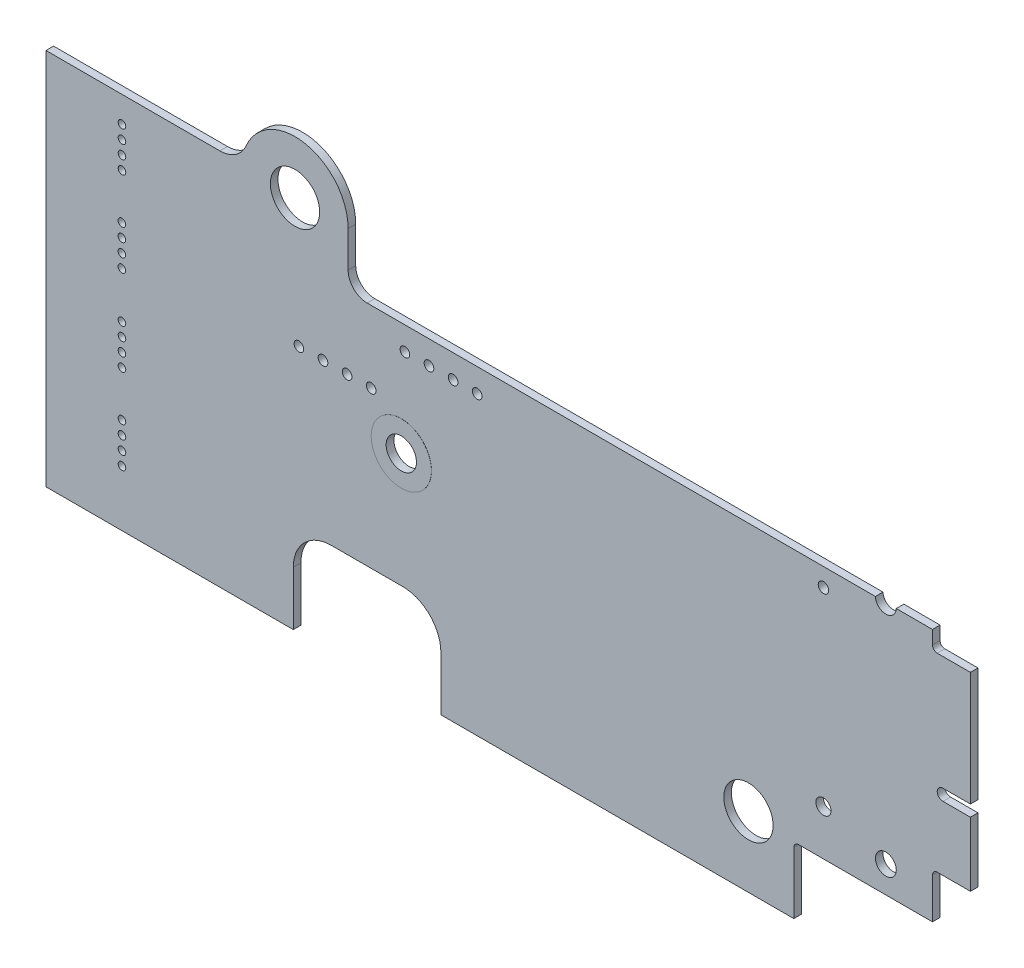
ISO-10303-21;
HEADER;
FILE_DESCRIPTION(('STEP AP214'),'2;1');
FILE_NAME('part.step','',(''),(''),'','','');
FILE_SCHEMA(('AUTOMOTIVE_DESIGN { 1 0 10303 214 1 1 1 1 }'));
ENDSEC;
DATA;
#1=APPLICATION_CONTEXT('core data for automotive mechanical design processes');
#2=APPLICATION_PROTOCOL_DEFINITION('international standard','automotive_design',2000,#1);
#3=PRODUCT_CONTEXT('',#1,'mechanical');
#4=PRODUCT('Part','Part','',(#3));
#5=PRODUCT_RELATED_PRODUCT_CATEGORY('part','',(#4));
#6=PRODUCT_DEFINITION_FORMATION('','',#4);
#7=PRODUCT_DEFINITION_CONTEXT('part definition',#1,'design');
#8=PRODUCT_DEFINITION('design','',#6,#7);
#9=PRODUCT_DEFINITION_SHAPE('','',#8);
#10=(LENGTH_UNIT() NAMED_UNIT(*) SI_UNIT(.MILLI.,.METRE.));
#11=(NAMED_UNIT(*) PLANE_ANGLE_UNIT() SI_UNIT($,.RADIAN.));
#12=(NAMED_UNIT(*) SI_UNIT($,.STERADIAN.) SOLID_ANGLE_UNIT());
#13=UNCERTAINTY_MEASURE_WITH_UNIT(LENGTH_MEASURE(1.E-05),#10,'distance_accuracy_value','');
#14=(GEOMETRIC_REPRESENTATION_CONTEXT(3) GLOBAL_UNCERTAINTY_ASSIGNED_CONTEXT((#13)) GLOBAL_UNIT_ASSIGNED_CONTEXT((#10,
#11,#12)) REPRESENTATION_CONTEXT('',''));
#15=CARTESIAN_POINT('',(0.,0.,0.));
#16=DIRECTION('',(0.,0.,1.));
#17=DIRECTION('',(1.,0.,0.));
#18=AXIS2_PLACEMENT_3D('',#15,#16,#17);
#19=CARTESIAN_POINT('',(30.0799999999,5.69999999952,0.));
#20=DIRECTION('',(0.,0.,-1.));
#21=DIRECTION('',(-1.,0.,0.));
#22=AXIS2_PLACEMENT_3D('',#19,#20,#21);
#23=PLANE('',#22);
#24=DIRECTION('',(-1.,0.,0.));
#25=VECTOR('',#24,1.);
#26=CARTESIAN_POINT('',(18.32999999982,39.85000000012,0.));
#27=LINE('',#26,#25);
#28=CARTESIAN_POINT('',(18.32999999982,39.85000000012,0.));
#29=VERTEX_POINT('',#28);
#30=CARTESIAN_POINT('',(0.,39.85000000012,0.));
#31=VERTEX_POINT('',#30);
#32=EDGE_CURVE('E266',#29,#31,#27,.T.);
#33=ORIENTED_EDGE('',*,*,#32,.F.);
#34=CARTESIAN_POINT('',(18.332316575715,42.8515397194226,0.));
#35=DIRECTION('',(0.,0.,-1.));
#36=DIRECTION('',(-1.,0.,0.));
#37=AXIS2_PLACEMENT_3D('',#34,#35,#36);
#38=CIRCLE('',#37,3.00154061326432);
#39=CARTESIAN_POINT('',(21.09999999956,41.69000000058,0.));
#40=VERTEX_POINT('',#39);
#41=EDGE_CURVE('E153',#40,#29,#38,.T.);
#42=ORIENTED_EDGE('',*,*,#41,.F.);
#43=CARTESIAN_POINT('',(26.2611385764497,39.519770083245,0.));
#44=DIRECTION('',(0.,0.,1.));
#45=DIRECTION('',(1.,0.,0.));
#46=AXIS2_PLACEMENT_3D('',#43,#44,#45);
#47=CIRCLE('',#46,5.59886142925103);
#48=CARTESIAN_POINT('',(31.86000000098,39.51999999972,0.));
#49=VERTEX_POINT('',#48);
#50=EDGE_CURVE('E147',#49,#40,#47,.T.);
#51=ORIENTED_EDGE('',*,*,#50,.F.);
#52=DIRECTION('',(0.,1.,0.));
#53=VECTOR('',#52,1.);
#54=CARTESIAN_POINT('',(31.86000000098,35.72000000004,0.));
#55=LINE('',#54,#53);
#56=CARTESIAN_POINT('',(31.86000000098,35.72000000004,0.));
#57=VERTEX_POINT('',#56);
#58=EDGE_CURVE('E256',#57,#49,#55,.T.);
#59=ORIENTED_EDGE('',*,*,#58,.F.);
#60=CARTESIAN_POINT('',(33.86000000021,35.71999999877,0.));
#61=DIRECTION('',(0.,0.,-1.));
#62=DIRECTION('',(-1.,0.,0.));
#63=AXIS2_PLACEMENT_3D('',#60,#61,#62);
#64=CIRCLE('',#63,1.99999999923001);
#65=CARTESIAN_POINT('',(33.85999999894,33.71999999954,0.));
#66=VERTEX_POINT('',#65);
#67=EDGE_CURVE('E320',#66,#57,#64,.T.);
#68=ORIENTED_EDGE('',*,*,#67,.F.);
#69=DIRECTION('',(-1.,0.,0.));
#70=VECTOR('',#69,1.);
#71=CARTESIAN_POINT('',(87.45999999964,33.71999999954,0.));
#72=LINE('',#71,#70);
#73=CARTESIAN_POINT('',(87.45999999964,33.71999999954,0.));
#74=VERTEX_POINT('',#73);
#75=EDGE_CURVE('E318',#74,#66,#72,.T.);
#76=ORIENTED_EDGE('',*,*,#75,.F.);
#77=CARTESIAN_POINT('',(88.55999999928,33.7599999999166,0.));
#78=DIRECTION('',(0.,0.,-1.));
#79=DIRECTION('',(-1.,0.,0.));
#80=AXIS2_PLACEMENT_3D('',#77,#78,#79);
#81=CIRCLE('',#80,1.10072703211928);
#82=CARTESIAN_POINT('',(89.65999999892,33.71999999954,0.));
#83=VERTEX_POINT('',#82);
#84=EDGE_CURVE('E316',#83,#74,#81,.T.);
#85=ORIENTED_EDGE('',*,*,#84,.F.);
#86=DIRECTION('',(-1.,0.,0.));
#87=VECTOR('',#86,1.);
#88=CARTESIAN_POINT('',(93.47999999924,33.71999999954,0.));
#89=LINE('',#88,#87);
#90=CARTESIAN_POINT('',(93.47999999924,33.71999999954,0.));
#91=VERTEX_POINT('',#90);
#92=EDGE_CURVE('E314',#91,#83,#89,.T.);
#93=ORIENTED_EDGE('',*,*,#92,.F.);
#94=DIRECTION('',(0.,1.,0.));
#95=VECTOR('',#94,1.);
#96=CARTESIAN_POINT('',(93.47999999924,32.29999999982,0.));
#97=LINE('',#96,#95);
#98=CARTESIAN_POINT('',(93.47999999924,32.29999999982,0.));
#99=VERTEX_POINT('',#98);
#100=EDGE_CURVE('E312',#99,#91,#97,.T.);
#101=ORIENTED_EDGE('',*,*,#100,.F.);
#102=CARTESIAN_POINT('',(93.98,32.29999999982,0.));
#103=DIRECTION('',(0.,0.,-1.));
#104=DIRECTION('',(-1.,0.,0.));
#105=AXIS2_PLACEMENT_3D('',#102,#103,#104);
#106=CIRCLE('',#105,0.500000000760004);
#107=CARTESIAN_POINT('',(93.98,31.79999999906,0.));
#108=VERTEX_POINT('',#107);
#109=EDGE_CURVE('E310',#108,#99,#106,.T.);
#110=ORIENTED_EDGE('',*,*,#109,.F.);
#111=DIRECTION('',(-1.,0.,0.));
#112=VECTOR('',#111,1.);
#113=CARTESIAN_POINT('',(97.48000000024,31.79999999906,0.));
#114=LINE('',#113,#112);
#115=CARTESIAN_POINT('',(97.48000000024,31.79999999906,0.));
#116=VERTEX_POINT('',#115);
#117=EDGE_CURVE('E308',#116,#108,#114,.T.);
#118=ORIENTED_EDGE('',*,*,#117,.F.);
#119=DIRECTION('',(0.,1.,0.));
#120=VECTOR('',#119,1.);
#121=CARTESIAN_POINT('',(97.48000000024,19.77000000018,0.));
#122=LINE('',#121,#120);
#123=CARTESIAN_POINT('',(97.48000000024,19.77000000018,0.));
#124=VERTEX_POINT('',#123);
#125=EDGE_CURVE('E306',#124,#116,#122,.T.);
#126=ORIENTED_EDGE('',*,*,#125,.F.);
#127=DIRECTION('',(1.,0.,0.));
#128=VECTOR('',#127,1.);
#129=CARTESIAN_POINT('',(94.57999999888,19.77000000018,0.));
#130=LINE('',#129,#128);
#131=CARTESIAN_POINT('',(94.57999999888,19.77000000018,0.));
#132=VERTEX_POINT('',#131);
#133=EDGE_CURVE('E304',#132,#124,#130,.T.);
#134=ORIENTED_EDGE('',*,*,#133,.F.);
#135=CARTESIAN_POINT('',(94.57999999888,19.17000000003,0.));
#136=DIRECTION('',(0.,0.,-1.));
#137=DIRECTION('',(-1.,0.,0.));
#138=AXIS2_PLACEMENT_3D('',#135,#136,#137);
#139=CIRCLE('',#138,0.60000000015);
#140=CARTESIAN_POINT('',(94.57999999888,18.56999999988,0.));
#141=VERTEX_POINT('',#140);
#142=EDGE_CURVE('E302',#141,#132,#139,.T.);
#143=ORIENTED_EDGE('',*,*,#142,.F.);
#144=DIRECTION('',(-1.,0.,0.));
#145=VECTOR('',#144,1.);
#146=CARTESIAN_POINT('',(97.48000000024,18.56999999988,0.));
#147=LINE('',#146,#145);
#148=CARTESIAN_POINT('',(97.48000000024,18.56999999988,0.));
#149=VERTEX_POINT('',#148);
#150=EDGE_CURVE('E300',#149,#141,#147,.T.);
#151=ORIENTED_EDGE('',*,*,#150,.F.);
#152=DIRECTION('',(0.,1.,0.));
#153=VECTOR('',#152,1.);
#154=CARTESIAN_POINT('',(97.48000000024,11.79999999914,0.));
#155=LINE('',#154,#153);
#156=CARTESIAN_POINT('',(97.48000000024,11.79999999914,0.));
#157=VERTEX_POINT('',#156);
#158=EDGE_CURVE('E298',#157,#149,#155,.T.);
#159=ORIENTED_EDGE('',*,*,#158,.F.);
#160=DIRECTION('',(1.,0.,0.));
#161=VECTOR('',#160,1.);
#162=CARTESIAN_POINT('',(93.98,11.79999999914,0.));
#163=LINE('',#162,#161);
#164=CARTESIAN_POINT('',(93.98,11.79999999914,0.));
#165=VERTEX_POINT('',#164);
#166=EDGE_CURVE('E296',#165,#157,#163,.T.);
#167=ORIENTED_EDGE('',*,*,#166,.F.);
#168=CARTESIAN_POINT('',(93.97999999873,11.29999999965,0.));
#169=DIRECTION('',(0.,0.,-1.));
#170=DIRECTION('',(-1.,0.,0.));
#171=AXIS2_PLACEMENT_3D('',#168,#169,#170);
#172=CIRCLE('',#171,0.499999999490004);
#173=CARTESIAN_POINT('',(93.47999999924,11.30000000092,0.));
#174=VERTEX_POINT('',#173);
#175=EDGE_CURVE('E294',#174,#165,#172,.T.);
#176=ORIENTED_EDGE('',*,*,#175,.F.);
#177=DIRECTION('',(0.,1.,0.));
#178=VECTOR('',#177,1.);
#179=CARTESIAN_POINT('',(93.47999999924,7.0100000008,0.));
#180=LINE('',#179,#178);
#181=CARTESIAN_POINT('',(93.47999999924,7.0100000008,0.));
#182=VERTEX_POINT('',#181);
#183=EDGE_CURVE('E292',#182,#174,#180,.T.);
#184=ORIENTED_EDGE('',*,*,#183,.F.);
#185=DIRECTION('',(1.,0.,0.));
#186=VECTOR('',#185,1.);
#187=CARTESIAN_POINT('',(79.35999999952,7.0100000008,0.));
#188=LINE('',#187,#186);
#189=CARTESIAN_POINT('',(79.35999999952,7.0100000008,0.));
#190=VERTEX_POINT('',#189);
#191=EDGE_CURVE('E290',#190,#182,#188,.T.);
#192=ORIENTED_EDGE('',*,*,#191,.F.);
#193=CARTESIAN_POINT('',(79.35999999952,6.51000000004,0.));
#194=DIRECTION('',(0.,0.,-1.));
#195=DIRECTION('',(-1.,0.,0.));
#196=AXIS2_PLACEMENT_3D('',#193,#194,#195);
#197=CIRCLE('',#196,0.500000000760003);
#198=CARTESIAN_POINT('',(78.85999999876,6.51000000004,0.));
#199=VERTEX_POINT('',#198);
#200=EDGE_CURVE('E288',#199,#190,#197,.T.);
#201=ORIENTED_EDGE('',*,*,#200,.F.);
#202=DIRECTION('',(0.,1.,0.));
#203=VECTOR('',#202,1.);
#204=CARTESIAN_POINT('',(78.85999999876,0.,0.));
#205=LINE('',#204,#203);
#206=CARTESIAN_POINT('',(78.85999999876,0.,0.));
#207=VERTEX_POINT('',#206);
#208=EDGE_CURVE('E286',#207,#199,#205,.T.);
#209=ORIENTED_EDGE('',*,*,#208,.F.);
#210=DIRECTION('',(1.,0.,0.));
#211=VECTOR('',#210,1.);
#212=CARTESIAN_POINT('',(41.63999999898,0.,0.));
#213=LINE('',#212,#211);
#214=CARTESIAN_POINT('',(41.63999999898,0.,0.));
#215=VERTEX_POINT('',#214);
#216=EDGE_CURVE('E284',#215,#207,#213,.T.);
#217=ORIENTED_EDGE('',*,*,#216,.F.);
#218=DIRECTION('',(0.,-1.,0.));
#219=VECTOR('',#218,1.);
#220=CARTESIAN_POINT('',(41.63999999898,5.69999999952,0.));
#221=LINE('',#220,#219);
#222=CARTESIAN_POINT('',(41.63999999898,5.69999999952,0.));
#223=VERTEX_POINT('',#222);
#224=EDGE_CURVE('E282',#223,#215,#221,.T.);
#225=ORIENTED_EDGE('',*,*,#224,.F.);
#226=CARTESIAN_POINT('',(37.63999999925,5.70000000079,0.));
#227=DIRECTION('',(0.,0.,-1.));
#228=DIRECTION('',(-1.,0.,0.));
#229=AXIS2_PLACEMENT_3D('',#226,#227,#228);
#230=CIRCLE('',#229,3.99999999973);
#231=CARTESIAN_POINT('',(37.64000000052,9.70000000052,0.));
#232=VERTEX_POINT('',#231);
#233=EDGE_CURVE('E280',#232,#223,#230,.T.);
#234=ORIENTED_EDGE('',*,*,#233,.F.);
#235=DIRECTION('',(1.,0.,0.));
#236=VECTOR('',#235,1.);
#237=CARTESIAN_POINT('',(30.0799999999,9.70000000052,0.));
#238=LINE('',#237,#236);
#239=CARTESIAN_POINT('',(30.0799999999,9.70000000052,0.));
#240=VERTEX_POINT('',#239);
#241=EDGE_CURVE('E278',#240,#232,#238,.T.);
#242=ORIENTED_EDGE('',*,*,#241,.F.);
#243=CARTESIAN_POINT('',(30.0799999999,5.69999999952,0.));
#244=DIRECTION('',(0.,0.,-1.));
#245=DIRECTION('',(-1.,0.,0.));
#246=AXIS2_PLACEMENT_3D('',#243,#244,#245);
#247=CIRCLE('',#246,4.000000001);
#248=CARTESIAN_POINT('',(26.0799999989,5.69999999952,0.));
#249=VERTEX_POINT('',#248);
#250=EDGE_CURVE('E276',#249,#240,#247,.T.);
#251=ORIENTED_EDGE('',*,*,#250,.F.);
#252=DIRECTION('',(0.,1.,0.));
#253=VECTOR('',#252,1.);
#254=CARTESIAN_POINT('',(26.0799999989,0.,0.));
#255=LINE('',#254,#253);
#256=CARTESIAN_POINT('',(26.0799999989,0.,0.));
#257=VERTEX_POINT('',#256);
#258=EDGE_CURVE('E274',#257,#249,#255,.T.);
#259=ORIENTED_EDGE('',*,*,#258,.F.);
#260=DIRECTION('',(1.,0.,0.));
#261=VECTOR('',#260,1.);
#262=CARTESIAN_POINT('',(0.,0.,0.));
#263=LINE('',#262,#261);
#264=CARTESIAN_POINT('',(0.,0.,0.));
#265=VERTEX_POINT('',#264);
#266=EDGE_CURVE('E272',#265,#257,#263,.T.);
#267=ORIENTED_EDGE('',*,*,#266,.F.);
#268=DIRECTION('',(0.,-1.,0.));
#269=VECTOR('',#268,1.);
#270=CARTESIAN_POINT('',(0.,39.85000000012,0.));
#271=LINE('',#270,#269);
#272=EDGE_CURVE('E269',#31,#265,#271,.T.);
#273=ORIENTED_EDGE('',*,*,#272,.F.);
#274=EDGE_LOOP('',(#33,#42,#51,#59,#68,#76,#85,#93,#101,#110,#118,#126,#134,#143,#151,#159,#167,
#176,#184,#192,#201,#209,#217,#225,#234,#242,#251,#259,#267,#273));
#275=FACE_BOUND('',#274,.T.);
#276=CARTESIAN_POINT('',(8.0109819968,10.1093569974,0.));
#277=DIRECTION('',(0.,0.,1.));
#278=DIRECTION('',(1.,0.,0.));
#279=AXIS2_PLACEMENT_3D('',#276,#277,#278);
#280=CIRCLE('',#279,0.400000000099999);
#281=CARTESIAN_POINT('',(8.4109819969,10.1093569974,0.));
#282=VERTEX_POINT('',#281);
#283=EDGE_CURVE('E270',#282,#282,#280,.T.);
#284=ORIENTED_EDGE('',*,*,#283,.T.);
#285=EDGE_LOOP('',(#284));
#286=FACE_BOUND('',#285,.T.);
#287=CARTESIAN_POINT('',(8.0109819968,8.7093570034,0.));
#288=DIRECTION('',(0.,0.,1.));
#289=DIRECTION('',(1.,0.,0.));
#290=AXIS2_PLACEMENT_3D('',#287,#288,#289);
#291=CIRCLE('',#290,0.400000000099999);
#292=CARTESIAN_POINT('',(8.4109819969,8.7093570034,0.));
#293=VERTEX_POINT('',#292);
#294=EDGE_CURVE('E1367',#293,#293,#291,.T.);
#295=ORIENTED_EDGE('',*,*,#294,.T.);
#296=EDGE_LOOP('',(#295));
#297=FACE_BOUND('',#296,.T.);
#298=CARTESIAN_POINT('',(8.0109819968,7.3093570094,0.));
#299=DIRECTION('',(0.,0.,1.));
#300=DIRECTION('',(1.,0.,0.));
#301=AXIS2_PLACEMENT_3D('',#298,#299,#300);
#302=CIRCLE('',#301,0.400000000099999);
#303=CARTESIAN_POINT('',(8.4109819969,7.3093570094,0.));
#304=VERTEX_POINT('',#303);
#305=EDGE_CURVE('E1361',#304,#304,#302,.T.);
#306=ORIENTED_EDGE('',*,*,#305,.T.);
#307=EDGE_LOOP('',(#306));
#308=FACE_BOUND('',#307,.T.);
#309=CARTESIAN_POINT('',(8.0109819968,5.90935699,0.));
#310=DIRECTION('',(0.,0.,1.));
#311=DIRECTION('',(1.,0.,0.));
#312=AXIS2_PLACEMENT_3D('',#309,#310,#311);
#313=CIRCLE('',#312,0.400000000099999);
#314=CARTESIAN_POINT('',(8.4109819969,5.90935699,0.));
#315=VERTEX_POINT('',#314);
#316=EDGE_CURVE('E1355',#315,#315,#313,.T.);
#317=ORIENTED_EDGE('',*,*,#316,.T.);
#318=EDGE_LOOP('',(#317));
#319=FACE_BOUND('',#318,.T.);
#320=CARTESIAN_POINT('',(8.001,28.134999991,0.));
#321=DIRECTION('',(0.,0.,1.));
#322=DIRECTION('',(1.,0.,0.));
#323=AXIS2_PLACEMENT_3D('',#320,#321,#322);
#324=CIRCLE('',#323,0.400000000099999);
#325=CARTESIAN_POINT('',(8.4010000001,28.134999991,0.));
#326=VERTEX_POINT('',#325);
#327=EDGE_CURVE('E1349',#326,#326,#324,.T.);
#328=ORIENTED_EDGE('',*,*,#327,.T.);
#329=EDGE_LOOP('',(#328));
#330=FACE_BOUND('',#329,.T.);
#331=CARTESIAN_POINT('',(8.001,26.734999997,0.));
#332=DIRECTION('',(0.,0.,1.));
#333=DIRECTION('',(1.,0.,0.));
#334=AXIS2_PLACEMENT_3D('',#331,#332,#333);
#335=CIRCLE('',#334,0.400000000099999);
#336=CARTESIAN_POINT('',(8.4010000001,26.734999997,0.));
#337=VERTEX_POINT('',#336);
#338=EDGE_CURVE('E1343',#337,#337,#335,.T.);
#339=ORIENTED_EDGE('',*,*,#338,.T.);
#340=EDGE_LOOP('',(#339));
#341=FACE_BOUND('',#340,.T.);
#342=CARTESIAN_POINT('',(8.001,25.335000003,0.));
#343=DIRECTION('',(0.,0.,1.));
#344=DIRECTION('',(1.,0.,0.));
#345=AXIS2_PLACEMENT_3D('',#342,#343,#344);
#346=CIRCLE('',#345,0.400000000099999);
#347=CARTESIAN_POINT('',(8.4010000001,25.335000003,0.));
#348=VERTEX_POINT('',#347);
#349=EDGE_CURVE('E1337',#348,#348,#346,.T.);
#350=ORIENTED_EDGE('',*,*,#349,.T.);
#351=EDGE_LOOP('',(#350));
#352=FACE_BOUND('',#351,.T.);
#353=CARTESIAN_POINT('',(8.001,23.935000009,0.));
#354=DIRECTION('',(0.,0.,1.));
#355=DIRECTION('',(1.,0.,0.));
#356=AXIS2_PLACEMENT_3D('',#353,#354,#355);
#357=CIRCLE('',#356,0.400000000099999);
#358=CARTESIAN_POINT('',(8.4010000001,23.935000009,0.));
#359=VERTEX_POINT('',#358);
#360=EDGE_CURVE('E1331',#359,#359,#357,.T.);
#361=ORIENTED_EDGE('',*,*,#360,.T.);
#362=EDGE_LOOP('',(#361));
#363=FACE_BOUND('',#362,.T.);
#364=CARTESIAN_POINT('',(8.0109719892,19.0923679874,0.));
#365=DIRECTION('',(0.,0.,1.));
#366=DIRECTION('',(1.,0.,0.));
#367=AXIS2_PLACEMENT_3D('',#364,#365,#366);
#368=CIRCLE('',#367,0.400000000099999);
#369=CARTESIAN_POINT('',(8.4109719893,19.0923679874,0.));
#370=VERTEX_POINT('',#369);
#371=EDGE_CURVE('E1325',#370,#370,#368,.T.);
#372=ORIENTED_EDGE('',*,*,#371,.T.);
#373=EDGE_LOOP('',(#372));
#374=FACE_BOUND('',#373,.T.);
#375=CARTESIAN_POINT('',(8.0109719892,17.6923679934,0.));
#376=DIRECTION('',(0.,0.,1.));
#377=DIRECTION('',(1.,0.,0.));
#378=AXIS2_PLACEMENT_3D('',#375,#376,#377);
#379=CIRCLE('',#378,0.400000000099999);
#380=CARTESIAN_POINT('',(8.4109719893,17.6923679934,0.));
#381=VERTEX_POINT('',#380);
#382=EDGE_CURVE('E1319',#381,#381,#379,.T.);
#383=ORIENTED_EDGE('',*,*,#382,.T.);
#384=EDGE_LOOP('',(#383));
#385=FACE_BOUND('',#384,.T.);
#386=CARTESIAN_POINT('',(8.0109719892,16.2923679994,0.));
#387=DIRECTION('',(0.,0.,1.));
#388=DIRECTION('',(1.,0.,0.));
#389=AXIS2_PLACEMENT_3D('',#386,#387,#388);
#390=CIRCLE('',#389,0.400000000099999);
#391=CARTESIAN_POINT('',(8.4109719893,16.2923679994,0.));
#392=VERTEX_POINT('',#391);
#393=EDGE_CURVE('E1313',#392,#392,#390,.T.);
#394=ORIENTED_EDGE('',*,*,#393,.T.);
#395=EDGE_LOOP('',(#394));
#396=FACE_BOUND('',#395,.T.);
#397=CARTESIAN_POINT('',(8.0109719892,14.8923680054,0.));
#398=DIRECTION('',(0.,0.,1.));
#399=DIRECTION('',(1.,0.,0.));
#400=AXIS2_PLACEMENT_3D('',#397,#398,#399);
#401=CIRCLE('',#400,0.400000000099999);
#402=CARTESIAN_POINT('',(8.4109719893,14.8923680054,0.));
#403=VERTEX_POINT('',#402);
#404=EDGE_CURVE('E1307',#403,#403,#401,.T.);
#405=ORIENTED_EDGE('',*,*,#404,.T.);
#406=EDGE_LOOP('',(#405));
#407=FACE_BOUND('',#406,.T.);
#408=CARTESIAN_POINT('',(8.0109719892,37.109367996,0.));
#409=DIRECTION('',(0.,0.,1.));
#410=DIRECTION('',(1.,0.,0.));
#411=AXIS2_PLACEMENT_3D('',#408,#409,#410);
#412=CIRCLE('',#411,0.400000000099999);
#413=CARTESIAN_POINT('',(8.4109719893,37.109367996,0.));
#414=VERTEX_POINT('',#413);
#415=EDGE_CURVE('E1301',#414,#414,#412,.T.);
#416=ORIENTED_EDGE('',*,*,#415,.T.);
#417=EDGE_LOOP('',(#416));
#418=FACE_BOUND('',#417,.T.);
#419=CARTESIAN_POINT('',(8.0109719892,35.709368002,0.));
#420=DIRECTION('',(0.,0.,1.));
#421=DIRECTION('',(1.,0.,0.));
#422=AXIS2_PLACEMENT_3D('',#419,#420,#421);
#423=CIRCLE('',#422,0.400000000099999);
#424=CARTESIAN_POINT('',(8.4109719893,35.709368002,0.));
#425=VERTEX_POINT('',#424);
#426=EDGE_CURVE('E1295',#425,#425,#423,.T.);
#427=ORIENTED_EDGE('',*,*,#426,.T.);
#428=EDGE_LOOP('',(#427));
#429=FACE_BOUND('',#428,.T.);
#430=CARTESIAN_POINT('',(8.0109719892,34.309368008,0.));
#431=DIRECTION('',(0.,0.,1.));
#432=DIRECTION('',(1.,0.,0.));
#433=AXIS2_PLACEMENT_3D('',#430,#431,#432);
#434=CIRCLE('',#433,0.400000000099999);
#435=CARTESIAN_POINT('',(8.4109719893,34.309368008,0.));
#436=VERTEX_POINT('',#435);
#437=EDGE_CURVE('E1289',#436,#436,#434,.T.);
#438=ORIENTED_EDGE('',*,*,#437,.T.);
#439=EDGE_LOOP('',(#438));
#440=FACE_BOUND('',#439,.T.);
#441=CARTESIAN_POINT('',(8.0109719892,32.9093679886,0.));
#442=DIRECTION('',(0.,0.,1.));
#443=DIRECTION('',(1.,0.,0.));
#444=AXIS2_PLACEMENT_3D('',#441,#442,#443);
#445=CIRCLE('',#444,0.400000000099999);
#446=CARTESIAN_POINT('',(8.4109719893,32.9093679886,0.));
#447=VERTEX_POINT('',#446);
#448=EDGE_CURVE('E1283',#447,#447,#445,.T.);
#449=ORIENTED_EDGE('',*,*,#448,.T.);
#450=EDGE_LOOP('',(#449));
#451=FACE_BOUND('',#450,.T.);
#452=CARTESIAN_POINT('',(26.67,26.162,0.));
#453=DIRECTION('',(0.,0.,1.));
#454=DIRECTION('',(1.,0.,0.));
#455=AXIS2_PLACEMENT_3D('',#452,#453,#454);
#456=CIRCLE('',#455,0.508000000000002);
#457=CARTESIAN_POINT('',(27.178,26.162,0.));
#458=VERTEX_POINT('',#457);
#459=EDGE_CURVE('E1277',#458,#458,#456,.T.);
#460=ORIENTED_EDGE('',*,*,#459,.T.);
#461=EDGE_LOOP('',(#460));
#462=FACE_BOUND('',#461,.T.);
#463=CARTESIAN_POINT('',(29.21,26.162,0.));
#464=DIRECTION('',(0.,0.,1.));
#465=DIRECTION('',(1.,0.,0.));
#466=AXIS2_PLACEMENT_3D('',#463,#464,#465);
#467=CIRCLE('',#466,0.508000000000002);
#468=CARTESIAN_POINT('',(29.718,26.162,0.));
#469=VERTEX_POINT('',#468);
#470=EDGE_CURVE('E1271',#469,#469,#467,.T.);
#471=ORIENTED_EDGE('',*,*,#470,.T.);
#472=EDGE_LOOP('',(#471));
#473=FACE_BOUND('',#472,.T.);
#474=CARTESIAN_POINT('',(31.75,26.162,0.));
#475=DIRECTION('',(0.,0.,1.));
#476=DIRECTION('',(1.,0.,0.));
#477=AXIS2_PLACEMENT_3D('',#474,#475,#476);
#478=CIRCLE('',#477,0.508000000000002);
#479=CARTESIAN_POINT('',(32.258,26.162,0.));
#480=VERTEX_POINT('',#479);
#481=EDGE_CURVE('E1265',#480,#480,#478,.T.);
#482=ORIENTED_EDGE('',*,*,#481,.T.);
#483=EDGE_LOOP('',(#482));
#484=FACE_BOUND('',#483,.T.);
#485=CARTESIAN_POINT('',(34.29,26.162,0.));
#486=DIRECTION('',(0.,0.,1.));
#487=DIRECTION('',(1.,0.,0.));
#488=AXIS2_PLACEMENT_3D('',#485,#486,#487);
#489=CIRCLE('',#488,0.508000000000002);
#490=CARTESIAN_POINT('',(34.798,26.162,0.));
#491=VERTEX_POINT('',#490);
#492=EDGE_CURVE('E1259',#491,#491,#489,.T.);
#493=ORIENTED_EDGE('',*,*,#492,.T.);
#494=EDGE_LOOP('',(#493));
#495=FACE_BOUND('',#494,.T.);
#496=CARTESIAN_POINT('',(40.386,31.242,0.));
#497=DIRECTION('',(0.,0.,1.));
#498=DIRECTION('',(1.,0.,0.));
#499=AXIS2_PLACEMENT_3D('',#496,#497,#498);
#500=CIRCLE('',#499,0.508000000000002);
#501=CARTESIAN_POINT('',(40.894,31.242,0.));
#502=VERTEX_POINT('',#501);
#503=EDGE_CURVE('E1253',#502,#502,#500,.T.);
#504=ORIENTED_EDGE('',*,*,#503,.T.);
#505=EDGE_LOOP('',(#504));
#506=FACE_BOUND('',#505,.T.);
#507=CARTESIAN_POINT('',(42.926,31.242,0.));
#508=DIRECTION('',(0.,0.,1.));
#509=DIRECTION('',(1.,0.,0.));
#510=AXIS2_PLACEMENT_3D('',#507,#508,#509);
#511=CIRCLE('',#510,0.508000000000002);
#512=CARTESIAN_POINT('',(43.434,31.242,0.));
#513=VERTEX_POINT('',#512);
#514=EDGE_CURVE('E1247',#513,#513,#511,.T.);
#515=ORIENTED_EDGE('',*,*,#514,.T.);
#516=EDGE_LOOP('',(#515));
#517=FACE_BOUND('',#516,.T.);
#518=CARTESIAN_POINT('',(45.466,31.242,0.));
#519=DIRECTION('',(0.,0.,1.));
#520=DIRECTION('',(1.,0.,0.));
#521=AXIS2_PLACEMENT_3D('',#518,#519,#520);
#522=CIRCLE('',#521,0.508000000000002);
#523=CARTESIAN_POINT('',(45.974,31.242,0.));
#524=VERTEX_POINT('',#523);
#525=EDGE_CURVE('E1241',#524,#524,#522,.T.);
#526=ORIENTED_EDGE('',*,*,#525,.T.);
#527=EDGE_LOOP('',(#526));
#528=FACE_BOUND('',#527,.T.);
#529=CARTESIAN_POINT('',(37.846,31.242,0.));
#530=DIRECTION('',(0.,0.,1.));
#531=DIRECTION('',(1.,0.,0.));
#532=AXIS2_PLACEMENT_3D('',#529,#530,#531);
#533=CIRCLE('',#532,0.508000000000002);
#534=CARTESIAN_POINT('',(38.354,31.242,0.));
#535=VERTEX_POINT('',#534);
#536=EDGE_CURVE('E1235',#535,#535,#533,.T.);
#537=ORIENTED_EDGE('',*,*,#536,.T.);
#538=EDGE_LOOP('',(#537));
#539=FACE_BOUND('',#538,.T.);
#540=CARTESIAN_POINT('',(74.0740000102,7.4049999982,0.));
#541=DIRECTION('',(0.,0.,1.));
#542=DIRECTION('',(1.,0.,0.));
#543=AXIS2_PLACEMENT_3D('',#540,#541,#542);
#544=CIRCLE('',#543,2.5999999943);
#545=CARTESIAN_POINT('',(76.6740000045,7.4049999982,0.));
#546=VERTEX_POINT('',#545);
#547=EDGE_CURVE('E1229',#546,#546,#544,.T.);
#548=ORIENTED_EDGE('',*,*,#547,.T.);
#549=EDGE_LOOP('',(#548));
#550=FACE_BOUND('',#549,.T.);
#551=CARTESIAN_POINT('',(26.2590000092,39.5200000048,0.));
#552=DIRECTION('',(0.,0.,1.));
#553=DIRECTION('',(1.,0.,0.));
#554=AXIS2_PLACEMENT_3D('',#551,#552,#553);
#555=CIRCLE('',#554,2.5999999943);
#556=CARTESIAN_POINT('',(28.8590000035,39.5200000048,0.));
#557=VERTEX_POINT('',#556);
#558=EDGE_CURVE('E1223',#557,#557,#555,.T.);
#559=ORIENTED_EDGE('',*,*,#558,.T.);
#560=EDGE_LOOP('',(#559));
#561=FACE_BOUND('',#560,.T.);
#562=CARTESIAN_POINT('',(88.5619999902,9.8309999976,0.));
#563=DIRECTION('',(0.,0.,1.));
#564=DIRECTION('',(1.,0.,0.));
#565=AXIS2_PLACEMENT_3D('',#562,#563,#564);
#566=CIRCLE('',#565,1.0999999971);
#567=CARTESIAN_POINT('',(89.6619999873,9.8309999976,0.));
#568=VERTEX_POINT('',#567);
#569=EDGE_CURVE('E1217',#568,#568,#566,.T.);
#570=ORIENTED_EDGE('',*,*,#569,.T.);
#571=EDGE_LOOP('',(#570));
#572=FACE_BOUND('',#571,.T.);
#573=CARTESIAN_POINT('',(81.980999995,31.7929999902,0.));
#574=DIRECTION('',(0.,0.,1.));
#575=DIRECTION('',(1.,0.,0.));
#576=AXIS2_PLACEMENT_3D('',#573,#574,#575);
#577=CIRCLE('',#576,0.550000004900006);
#578=CARTESIAN_POINT('',(82.5309999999,31.7929999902,0.));
#579=VERTEX_POINT('',#578);
#580=EDGE_CURVE('E1211',#579,#579,#577,.T.);
#581=ORIENTED_EDGE('',*,*,#580,.T.);
#582=EDGE_LOOP('',(#581));
#583=FACE_BOUND('',#582,.T.);
#584=CARTESIAN_POINT('',(81.980999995,11.7930000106,0.));
#585=DIRECTION('',(0.,0.,1.));
#586=DIRECTION('',(1.,0.,0.));
#587=AXIS2_PLACEMENT_3D('',#584,#585,#586);
#588=CIRCLE('',#587,0.800000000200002);
#589=CARTESIAN_POINT('',(82.7809999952,11.7930000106,0.));
#590=VERTEX_POINT('',#589);
#591=EDGE_CURVE('E1205',#590,#590,#588,.T.);
#592=ORIENTED_EDGE('',*,*,#591,.T.);
#593=EDGE_LOOP('',(#592));
#594=FACE_BOUND('',#593,.T.);
#595=CARTESIAN_POINT('',(37.4760000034,21.7930000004,0.));
#596=DIRECTION('',(0.,0.,-1.));
#597=DIRECTION('',(-1.,0.,0.));
#598=AXIS2_PLACEMENT_3D('',#595,#596,#597);
#599=CIRCLE('',#598,3.175);
#600=CARTESIAN_POINT('',(40.6510000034,21.7930000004,0.));
#601=VERTEX_POINT('',#600);
#602=EDGE_CURVE('E1190',#601,#601,#599,.T.);
#603=ORIENTED_EDGE('',*,*,#602,.F.);
#604=EDGE_LOOP('',(#603));
#605=FACE_BOUND('',#604,.T.);
#606=ADVANCED_FACE('F35',(#275,#286,#297,#308,#319,#330,#341,#352,#363,#374,#385,#396,#407,#418,
#429,#440,#451,#462,#473,#484,#495,#506,#517,#528,#539,#550,#561,#572,#583,#594,#605),#23,.T.);
#607=CARTESIAN_POINT('',(30.0799999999,5.69999999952,0.8000000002));
#608=DIRECTION('',(0.,0.,-1.));
#609=DIRECTION('',(-1.,0.,0.));
#610=AXIS2_PLACEMENT_3D('',#607,#608,#609);
#611=PLANE('',#610);
#612=DIRECTION('',(-1.,0.,0.));
#613=VECTOR('',#612,1.);
#614=CARTESIAN_POINT('',(18.32999999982,39.85000000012,0.8000000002));
#615=LINE('',#614,#613);
#616=CARTESIAN_POINT('',(18.32999999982,39.85000000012,0.8000000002));
#617=VERTEX_POINT('',#616);
#618=CARTESIAN_POINT('',(0.,39.85000000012,0.8000000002));
#619=VERTEX_POINT('',#618);
#620=EDGE_CURVE('E325',#617,#619,#615,.T.);
#621=ORIENTED_EDGE('',*,*,#620,.T.);
#622=DIRECTION('',(0.,-1.,0.));
#623=VECTOR('',#622,1.);
#624=CARTESIAN_POINT('',(0.,39.85000000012,0.8000000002));
#625=LINE('',#624,#623);
#626=CARTESIAN_POINT('',(0.,0.,0.8000000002));
#627=VERTEX_POINT('',#626);
#628=EDGE_CURVE('E162',#619,#627,#625,.T.);
#629=ORIENTED_EDGE('',*,*,#628,.T.);
#630=DIRECTION('',(1.,0.,0.));
#631=VECTOR('',#630,1.);
#632=CARTESIAN_POINT('',(0.,0.,0.8000000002));
#633=LINE('',#632,#631);
#634=CARTESIAN_POINT('',(26.0799999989,0.,0.8000000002));
#635=VERTEX_POINT('',#634);
#636=EDGE_CURVE('E424',#627,#635,#633,.T.);
#637=ORIENTED_EDGE('',*,*,#636,.T.);
#638=DIRECTION('',(0.,1.,0.));
#639=VECTOR('',#638,1.);
#640=CARTESIAN_POINT('',(26.0799999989,0.,0.8000000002));
#641=LINE('',#640,#639);
#642=CARTESIAN_POINT('',(26.0799999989,5.69999999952,0.8000000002));
#643=VERTEX_POINT('',#642);
#644=EDGE_CURVE('E421',#635,#643,#641,.T.);
#645=ORIENTED_EDGE('',*,*,#644,.T.);
#646=CARTESIAN_POINT('',(30.0799999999,5.69999999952,0.8000000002));
#647=DIRECTION('',(0.,0.,-1.));
#648=DIRECTION('',(-1.,0.,0.));
#649=AXIS2_PLACEMENT_3D('',#646,#647,#648);
#650=CIRCLE('',#649,4.000000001);
#651=CARTESIAN_POINT('',(30.0799999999,9.70000000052,0.8000000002));
#652=VERTEX_POINT('',#651);
#653=EDGE_CURVE('E423',#643,#652,#650,.T.);
#654=ORIENTED_EDGE('',*,*,#653,.T.);
#655=DIRECTION('',(1.,0.,0.));
#656=VECTOR('',#655,1.);
#657=CARTESIAN_POINT('',(30.0799999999,9.70000000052,0.8000000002));
#658=LINE('',#657,#656);
#659=CARTESIAN_POINT('',(37.64000000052,9.70000000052,0.8000000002));
#660=VERTEX_POINT('',#659);
#661=EDGE_CURVE('E426',#652,#660,#658,.T.);
#662=ORIENTED_EDGE('',*,*,#661,.T.);
#663=CARTESIAN_POINT('',(37.63999999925,5.70000000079,0.8000000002));
#664=DIRECTION('',(0.,0.,-1.));
#665=DIRECTION('',(-1.,0.,0.));
#666=AXIS2_PLACEMENT_3D('',#663,#664,#665);
#667=CIRCLE('',#666,3.99999999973);
#668=CARTESIAN_POINT('',(41.63999999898,5.69999999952,0.8000000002));
#669=VERTEX_POINT('',#668);
#670=EDGE_CURVE('E432',#660,#669,#667,.T.);
#671=ORIENTED_EDGE('',*,*,#670,.T.);
#672=DIRECTION('',(0.,-1.,0.));
#673=VECTOR('',#672,1.);
#674=CARTESIAN_POINT('',(41.63999999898,5.69999999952,0.8000000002));
#675=LINE('',#674,#673);
#676=CARTESIAN_POINT('',(41.63999999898,0.,0.8000000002));
#677=VERTEX_POINT('',#676);
#678=EDGE_CURVE('E434',#669,#677,#675,.T.);
#679=ORIENTED_EDGE('',*,*,#678,.T.);
#680=DIRECTION('',(1.,0.,0.));
#681=VECTOR('',#680,1.);
#682=CARTESIAN_POINT('',(41.63999999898,0.,0.8000000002));
#683=LINE('',#682,#681);
#684=CARTESIAN_POINT('',(78.85999999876,0.,0.8000000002));
#685=VERTEX_POINT('',#684);
#686=EDGE_CURVE('E436',#677,#685,#683,.T.);
#687=ORIENTED_EDGE('',*,*,#686,.T.);
#688=DIRECTION('',(0.,1.,0.));
#689=VECTOR('',#688,1.);
#690=CARTESIAN_POINT('',(78.85999999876,0.,0.8000000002));
#691=LINE('',#690,#689);
#692=CARTESIAN_POINT('',(78.85999999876,6.51000000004,0.8000000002));
#693=VERTEX_POINT('',#692);
#694=EDGE_CURVE('E438',#685,#693,#691,.T.);
#695=ORIENTED_EDGE('',*,*,#694,.T.);
#696=CARTESIAN_POINT('',(79.35999999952,6.51000000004,0.8000000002));
#697=DIRECTION('',(0.,0.,-1.));
#698=DIRECTION('',(-1.,0.,0.));
#699=AXIS2_PLACEMENT_3D('',#696,#697,#698);
#700=CIRCLE('',#699,0.500000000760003);
#701=CARTESIAN_POINT('',(79.35999999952,7.0100000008,0.8000000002));
#702=VERTEX_POINT('',#701);
#703=EDGE_CURVE('E440',#693,#702,#700,.T.);
#704=ORIENTED_EDGE('',*,*,#703,.T.);
#705=DIRECTION('',(1.,0.,0.));
#706=VECTOR('',#705,1.);
#707=CARTESIAN_POINT('',(79.35999999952,7.0100000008,0.8000000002));
#708=LINE('',#707,#706);
#709=CARTESIAN_POINT('',(93.47999999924,7.0100000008,0.8000000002));
#710=VERTEX_POINT('',#709);
#711=EDGE_CURVE('E442',#702,#710,#708,.T.);
#712=ORIENTED_EDGE('',*,*,#711,.T.);
#713=DIRECTION('',(0.,1.,0.));
#714=VECTOR('',#713,1.);
#715=CARTESIAN_POINT('',(93.47999999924,7.0100000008,0.8000000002));
#716=LINE('',#715,#714);
#717=CARTESIAN_POINT('',(93.47999999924,11.30000000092,0.8000000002));
#718=VERTEX_POINT('',#717);
#719=EDGE_CURVE('E444',#710,#718,#716,.T.);
#720=ORIENTED_EDGE('',*,*,#719,.T.);
#721=CARTESIAN_POINT('',(93.97999999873,11.29999999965,0.8000000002));
#722=DIRECTION('',(0.,0.,-1.));
#723=DIRECTION('',(-1.,0.,0.));
#724=AXIS2_PLACEMENT_3D('',#721,#722,#723);
#725=CIRCLE('',#724,0.499999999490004);
#726=CARTESIAN_POINT('',(93.98,11.79999999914,0.8000000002));
#727=VERTEX_POINT('',#726);
#728=EDGE_CURVE('E446',#718,#727,#725,.T.);
#729=ORIENTED_EDGE('',*,*,#728,.T.);
#730=DIRECTION('',(1.,0.,0.));
#731=VECTOR('',#730,1.);
#732=CARTESIAN_POINT('',(93.98,11.79999999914,0.8000000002));
#733=LINE('',#732,#731);
#734=CARTESIAN_POINT('',(97.48000000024,11.79999999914,0.8000000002));
#735=VERTEX_POINT('',#734);
#736=EDGE_CURVE('E448',#727,#735,#733,.T.);
#737=ORIENTED_EDGE('',*,*,#736,.T.);
#738=DIRECTION('',(0.,1.,0.));
#739=VECTOR('',#738,1.);
#740=CARTESIAN_POINT('',(97.48000000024,11.79999999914,0.8000000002));
#741=LINE('',#740,#739);
#742=CARTESIAN_POINT('',(97.48000000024,18.56999999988,0.8000000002));
#743=VERTEX_POINT('',#742);
#744=EDGE_CURVE('E450',#735,#743,#741,.T.);
#745=ORIENTED_EDGE('',*,*,#744,.T.);
#746=DIRECTION('',(-1.,0.,0.));
#747=VECTOR('',#746,1.);
#748=CARTESIAN_POINT('',(97.48000000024,18.56999999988,0.8000000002));
#749=LINE('',#748,#747);
#750=CARTESIAN_POINT('',(94.57999999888,18.56999999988,0.8000000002));
#751=VERTEX_POINT('',#750);
#752=EDGE_CURVE('E452',#743,#751,#749,.T.);
#753=ORIENTED_EDGE('',*,*,#752,.T.);
#754=CARTESIAN_POINT('',(94.57999999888,19.17000000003,0.8000000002));
#755=DIRECTION('',(0.,0.,-1.));
#756=DIRECTION('',(-1.,0.,0.));
#757=AXIS2_PLACEMENT_3D('',#754,#755,#756);
#758=CIRCLE('',#757,0.60000000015);
#759=CARTESIAN_POINT('',(94.57999999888,19.77000000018,0.8000000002));
#760=VERTEX_POINT('',#759);
#761=EDGE_CURVE('E454',#751,#760,#758,.T.);
#762=ORIENTED_EDGE('',*,*,#761,.T.);
#763=DIRECTION('',(1.,0.,0.));
#764=VECTOR('',#763,1.);
#765=CARTESIAN_POINT('',(94.57999999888,19.77000000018,0.8000000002));
#766=LINE('',#765,#764);
#767=CARTESIAN_POINT('',(97.48000000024,19.77000000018,0.8000000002));
#768=VERTEX_POINT('',#767);
#769=EDGE_CURVE('E456',#760,#768,#766,.T.);
#770=ORIENTED_EDGE('',*,*,#769,.T.);
#771=DIRECTION('',(0.,1.,0.));
#772=VECTOR('',#771,1.);
#773=CARTESIAN_POINT('',(97.48000000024,19.77000000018,0.8000000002));
#774=LINE('',#773,#772);
#775=CARTESIAN_POINT('',(97.48000000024,31.79999999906,0.8000000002));
#776=VERTEX_POINT('',#775);
#777=EDGE_CURVE('E458',#768,#776,#774,.T.);
#778=ORIENTED_EDGE('',*,*,#777,.T.);
#779=DIRECTION('',(-1.,0.,0.));
#780=VECTOR('',#779,1.);
#781=CARTESIAN_POINT('',(97.48000000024,31.79999999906,0.8000000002));
#782=LINE('',#781,#780);
#783=CARTESIAN_POINT('',(93.98,31.79999999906,0.8000000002));
#784=VERTEX_POINT('',#783);
#785=EDGE_CURVE('E460',#776,#784,#782,.T.);
#786=ORIENTED_EDGE('',*,*,#785,.T.);
#787=CARTESIAN_POINT('',(93.98,32.29999999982,0.8000000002));
#788=DIRECTION('',(0.,0.,-1.));
#789=DIRECTION('',(-1.,0.,0.));
#790=AXIS2_PLACEMENT_3D('',#787,#788,#789);
#791=CIRCLE('',#790,0.500000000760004);
#792=CARTESIAN_POINT('',(93.47999999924,32.29999999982,0.8000000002));
#793=VERTEX_POINT('',#792);
#794=EDGE_CURVE('E462',#784,#793,#791,.T.);
#795=ORIENTED_EDGE('',*,*,#794,.T.);
#796=DIRECTION('',(0.,1.,0.));
#797=VECTOR('',#796,1.);
#798=CARTESIAN_POINT('',(93.47999999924,32.29999999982,0.8000000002));
#799=LINE('',#798,#797);
#800=CARTESIAN_POINT('',(93.47999999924,33.71999999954,0.8000000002));
#801=VERTEX_POINT('',#800);
#802=EDGE_CURVE('E464',#793,#801,#799,.T.);
#803=ORIENTED_EDGE('',*,*,#802,.T.);
#804=DIRECTION('',(-1.,0.,0.));
#805=VECTOR('',#804,1.);
#806=CARTESIAN_POINT('',(93.47999999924,33.71999999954,0.8000000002));
#807=LINE('',#806,#805);
#808=CARTESIAN_POINT('',(89.65999999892,33.71999999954,0.8000000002));
#809=VERTEX_POINT('',#808);
#810=EDGE_CURVE('E466',#801,#809,#807,.T.);
#811=ORIENTED_EDGE('',*,*,#810,.T.);
#812=CARTESIAN_POINT('',(88.55999999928,33.7599999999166,0.8000000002));
#813=DIRECTION('',(0.,0.,-1.));
#814=DIRECTION('',(-1.,0.,0.));
#815=AXIS2_PLACEMENT_3D('',#812,#813,#814);
#816=CIRCLE('',#815,1.10072703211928);
#817=CARTESIAN_POINT('',(87.45999999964,33.71999999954,0.8000000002));
#818=VERTEX_POINT('',#817);
#819=EDGE_CURVE('E468',#809,#818,#816,.T.);
#820=ORIENTED_EDGE('',*,*,#819,.T.);
#821=DIRECTION('',(-1.,0.,0.));
#822=VECTOR('',#821,1.);
#823=CARTESIAN_POINT('',(87.45999999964,33.71999999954,0.8000000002));
#824=LINE('',#823,#822);
#825=CARTESIAN_POINT('',(33.85999999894,33.71999999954,0.8000000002));
#826=VERTEX_POINT('',#825);
#827=EDGE_CURVE('E470',#818,#826,#824,.T.);
#828=ORIENTED_EDGE('',*,*,#827,.T.);
#829=CARTESIAN_POINT('',(33.86000000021,35.71999999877,0.8000000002));
#830=DIRECTION('',(0.,0.,-1.));
#831=DIRECTION('',(-1.,0.,0.));
#832=AXIS2_PLACEMENT_3D('',#829,#830,#831);
#833=CIRCLE('',#832,1.99999999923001);
#834=CARTESIAN_POINT('',(31.86000000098,35.72000000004,0.8000000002));
#835=VERTEX_POINT('',#834);
#836=EDGE_CURVE('E248',#826,#835,#833,.T.);
#837=ORIENTED_EDGE('',*,*,#836,.T.);
#838=DIRECTION('',(0.,1.,0.));
#839=VECTOR('',#838,1.);
#840=CARTESIAN_POINT('',(31.86000000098,35.72000000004,0.8000000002));
#841=LINE('',#840,#839);
#842=CARTESIAN_POINT('',(31.86000000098,39.51999999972,0.8000000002));
#843=VERTEX_POINT('',#842);
#844=EDGE_CURVE('E241',#835,#843,#841,.T.);
#845=ORIENTED_EDGE('',*,*,#844,.T.);
#846=CARTESIAN_POINT('',(26.2611385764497,39.519770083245,0.8000000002));
#847=DIRECTION('',(0.,0.,1.));
#848=DIRECTION('',(1.,0.,0.));
#849=AXIS2_PLACEMENT_3D('',#846,#847,#848);
#850=CIRCLE('',#849,5.59886142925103);
#851=CARTESIAN_POINT('',(21.09999999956,41.69000000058,0.8000000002));
#852=VERTEX_POINT('',#851);
#853=EDGE_CURVE('E246',#843,#852,#850,.T.);
#854=ORIENTED_EDGE('',*,*,#853,.T.);
#855=CARTESIAN_POINT('',(18.332316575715,42.8515397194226,0.8000000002));
#856=DIRECTION('',(0.,0.,-1.));
#857=DIRECTION('',(-1.,0.,0.));
#858=AXIS2_PLACEMENT_3D('',#855,#856,#857);
#859=CIRCLE('',#858,3.00154061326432);
#860=EDGE_CURVE('E52',#852,#617,#859,.T.);
#861=ORIENTED_EDGE('',*,*,#860,.T.);
#862=EDGE_LOOP('',(#621,#629,#637,#645,#654,#662,#671,#679,#687,#695,#704,#712,#720,#729,#737,
#745,#753,#762,#770,#778,#786,#795,#803,#811,#820,#828,#837,#845,#854,#861));
#863=FACE_BOUND('',#862,.T.);
#864=CARTESIAN_POINT('',(8.0109819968,10.1093569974,0.8000000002));
#865=DIRECTION('',(0.,0.,1.));
#866=DIRECTION('',(1.,0.,0.));
#867=AXIS2_PLACEMENT_3D('',#864,#865,#866);
#868=CIRCLE('',#867,0.400000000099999);
#869=CARTESIAN_POINT('',(8.4109819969,10.1093569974,0.8000000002));
#870=VERTEX_POINT('',#869);
#871=EDGE_CURVE('E1370',#870,#870,#868,.T.);
#872=ORIENTED_EDGE('',*,*,#871,.F.);
#873=EDGE_LOOP('',(#872));
#874=FACE_BOUND('',#873,.T.);
#875=CARTESIAN_POINT('',(8.0109819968,8.7093570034,0.8000000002));
#876=DIRECTION('',(0.,0.,1.));
#877=DIRECTION('',(1.,0.,0.));
#878=AXIS2_PLACEMENT_3D('',#875,#876,#877);
#879=CIRCLE('',#878,0.400000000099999);
#880=CARTESIAN_POINT('',(8.4109819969,8.7093570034,0.8000000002));
#881=VERTEX_POINT('',#880);
#882=EDGE_CURVE('E1364',#881,#881,#879,.T.);
#883=ORIENTED_EDGE('',*,*,#882,.F.);
#884=EDGE_LOOP('',(#883));
#885=FACE_BOUND('',#884,.T.);
#886=CARTESIAN_POINT('',(8.0109819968,7.3093570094,0.8000000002));
#887=DIRECTION('',(0.,0.,1.));
#888=DIRECTION('',(1.,0.,0.));
#889=AXIS2_PLACEMENT_3D('',#886,#887,#888);
#890=CIRCLE('',#889,0.400000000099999);
#891=CARTESIAN_POINT('',(8.4109819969,7.3093570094,0.8000000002));
#892=VERTEX_POINT('',#891);
#893=EDGE_CURVE('E1358',#892,#892,#890,.T.);
#894=ORIENTED_EDGE('',*,*,#893,.F.);
#895=EDGE_LOOP('',(#894));
#896=FACE_BOUND('',#895,.T.);
#897=CARTESIAN_POINT('',(8.0109819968,5.90935699,0.8000000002));
#898=DIRECTION('',(0.,0.,1.));
#899=DIRECTION('',(1.,0.,0.));
#900=AXIS2_PLACEMENT_3D('',#897,#898,#899);
#901=CIRCLE('',#900,0.400000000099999);
#902=CARTESIAN_POINT('',(8.4109819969,5.90935699,0.8000000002));
#903=VERTEX_POINT('',#902);
#904=EDGE_CURVE('E1352',#903,#903,#901,.T.);
#905=ORIENTED_EDGE('',*,*,#904,.F.);
#906=EDGE_LOOP('',(#905));
#907=FACE_BOUND('',#906,.T.);
#908=CARTESIAN_POINT('',(8.001,28.134999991,0.8000000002));
#909=DIRECTION('',(0.,0.,1.));
#910=DIRECTION('',(1.,0.,0.));
#911=AXIS2_PLACEMENT_3D('',#908,#909,#910);
#912=CIRCLE('',#911,0.400000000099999);
#913=CARTESIAN_POINT('',(8.4010000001,28.134999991,0.8000000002));
#914=VERTEX_POINT('',#913);
#915=EDGE_CURVE('E1346',#914,#914,#912,.T.);
#916=ORIENTED_EDGE('',*,*,#915,.F.);
#917=EDGE_LOOP('',(#916));
#918=FACE_BOUND('',#917,.T.);
#919=CARTESIAN_POINT('',(8.001,26.734999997,0.8000000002));
#920=DIRECTION('',(0.,0.,1.));
#921=DIRECTION('',(1.,0.,0.));
#922=AXIS2_PLACEMENT_3D('',#919,#920,#921);
#923=CIRCLE('',#922,0.400000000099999);
#924=CARTESIAN_POINT('',(8.4010000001,26.734999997,0.8000000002));
#925=VERTEX_POINT('',#924);
#926=EDGE_CURVE('E1340',#925,#925,#923,.T.);
#927=ORIENTED_EDGE('',*,*,#926,.F.);
#928=EDGE_LOOP('',(#927));
#929=FACE_BOUND('',#928,.T.);
#930=CARTESIAN_POINT('',(8.001,25.335000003,0.8000000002));
#931=DIRECTION('',(0.,0.,1.));
#932=DIRECTION('',(1.,0.,0.));
#933=AXIS2_PLACEMENT_3D('',#930,#931,#932);
#934=CIRCLE('',#933,0.400000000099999);
#935=CARTESIAN_POINT('',(8.4010000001,25.335000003,0.8000000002));
#936=VERTEX_POINT('',#935);
#937=EDGE_CURVE('E1334',#936,#936,#934,.T.);
#938=ORIENTED_EDGE('',*,*,#937,.F.);
#939=EDGE_LOOP('',(#938));
#940=FACE_BOUND('',#939,.T.);
#941=CARTESIAN_POINT('',(8.001,23.935000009,0.8000000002));
#942=DIRECTION('',(0.,0.,1.));
#943=DIRECTION('',(1.,0.,0.));
#944=AXIS2_PLACEMENT_3D('',#941,#942,#943);
#945=CIRCLE('',#944,0.400000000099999);
#946=CARTESIAN_POINT('',(8.4010000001,23.935000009,0.8000000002));
#947=VERTEX_POINT('',#946);
#948=EDGE_CURVE('E1328',#947,#947,#945,.T.);
#949=ORIENTED_EDGE('',*,*,#948,.F.);
#950=EDGE_LOOP('',(#949));
#951=FACE_BOUND('',#950,.T.);
#952=CARTESIAN_POINT('',(8.0109719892,19.0923679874,0.8000000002));
#953=DIRECTION('',(0.,0.,1.));
#954=DIRECTION('',(1.,0.,0.));
#955=AXIS2_PLACEMENT_3D('',#952,#953,#954);
#956=CIRCLE('',#955,0.400000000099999);
#957=CARTESIAN_POINT('',(8.4109719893,19.0923679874,0.8000000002));
#958=VERTEX_POINT('',#957);
#959=EDGE_CURVE('E1322',#958,#958,#956,.T.);
#960=ORIENTED_EDGE('',*,*,#959,.F.);
#961=EDGE_LOOP('',(#960));
#962=FACE_BOUND('',#961,.T.);
#963=CARTESIAN_POINT('',(8.0109719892,17.6923679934,0.8000000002));
#964=DIRECTION('',(0.,0.,1.));
#965=DIRECTION('',(1.,0.,0.));
#966=AXIS2_PLACEMENT_3D('',#963,#964,#965);
#967=CIRCLE('',#966,0.400000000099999);
#968=CARTESIAN_POINT('',(8.4109719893,17.6923679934,0.8000000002));
#969=VERTEX_POINT('',#968);
#970=EDGE_CURVE('E1316',#969,#969,#967,.T.);
#971=ORIENTED_EDGE('',*,*,#970,.F.);
#972=EDGE_LOOP('',(#971));
#973=FACE_BOUND('',#972,.T.);
#974=CARTESIAN_POINT('',(8.0109719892,16.2923679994,0.8000000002));
#975=DIRECTION('',(0.,0.,1.));
#976=DIRECTION('',(1.,0.,0.));
#977=AXIS2_PLACEMENT_3D('',#974,#975,#976);
#978=CIRCLE('',#977,0.400000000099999);
#979=CARTESIAN_POINT('',(8.4109719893,16.2923679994,0.8000000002));
#980=VERTEX_POINT('',#979);
#981=EDGE_CURVE('E1310',#980,#980,#978,.T.);
#982=ORIENTED_EDGE('',*,*,#981,.F.);
#983=EDGE_LOOP('',(#982));
#984=FACE_BOUND('',#983,.T.);
#985=CARTESIAN_POINT('',(8.0109719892,14.8923680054,0.8000000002));
#986=DIRECTION('',(0.,0.,1.));
#987=DIRECTION('',(1.,0.,0.));
#988=AXIS2_PLACEMENT_3D('',#985,#986,#987);
#989=CIRCLE('',#988,0.400000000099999);
#990=CARTESIAN_POINT('',(8.4109719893,14.8923680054,0.8000000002));
#991=VERTEX_POINT('',#990);
#992=EDGE_CURVE('E1304',#991,#991,#989,.T.);
#993=ORIENTED_EDGE('',*,*,#992,.F.);
#994=EDGE_LOOP('',(#993));
#995=FACE_BOUND('',#994,.T.);
#996=CARTESIAN_POINT('',(8.0109719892,37.109367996,0.8000000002));
#997=DIRECTION('',(0.,0.,1.));
#998=DIRECTION('',(1.,0.,0.));
#999=AXIS2_PLACEMENT_3D('',#996,#997,#998);
#1000=CIRCLE('',#999,0.400000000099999);
#1001=CARTESIAN_POINT('',(8.4109719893,37.109367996,0.8000000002));
#1002=VERTEX_POINT('',#1001);
#1003=EDGE_CURVE('E1298',#1002,#1002,#1000,.T.);
#1004=ORIENTED_EDGE('',*,*,#1003,.F.);
#1005=EDGE_LOOP('',(#1004));
#1006=FACE_BOUND('',#1005,.T.);
#1007=CARTESIAN_POINT('',(8.0109719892,35.709368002,0.8000000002));
#1008=DIRECTION('',(0.,0.,1.));
#1009=DIRECTION('',(1.,0.,0.));
#1010=AXIS2_PLACEMENT_3D('',#1007,#1008,#1009);
#1011=CIRCLE('',#1010,0.400000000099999);
#1012=CARTESIAN_POINT('',(8.4109719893,35.709368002,0.8000000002));
#1013=VERTEX_POINT('',#1012);
#1014=EDGE_CURVE('E1292',#1013,#1013,#1011,.T.);
#1015=ORIENTED_EDGE('',*,*,#1014,.F.);
#1016=EDGE_LOOP('',(#1015));
#1017=FACE_BOUND('',#1016,.T.);
#1018=CARTESIAN_POINT('',(8.0109719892,34.309368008,0.8000000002));
#1019=DIRECTION('',(0.,0.,1.));
#1020=DIRECTION('',(1.,0.,0.));
#1021=AXIS2_PLACEMENT_3D('',#1018,#1019,#1020);
#1022=CIRCLE('',#1021,0.400000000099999);
#1023=CARTESIAN_POINT('',(8.4109719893,34.309368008,0.8000000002));
#1024=VERTEX_POINT('',#1023);
#1025=EDGE_CURVE('E1286',#1024,#1024,#1022,.T.);
#1026=ORIENTED_EDGE('',*,*,#1025,.F.);
#1027=EDGE_LOOP('',(#1026));
#1028=FACE_BOUND('',#1027,.T.);
#1029=CARTESIAN_POINT('',(8.0109719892,32.9093679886,0.8000000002));
#1030=DIRECTION('',(0.,0.,1.));
#1031=DIRECTION('',(1.,0.,0.));
#1032=AXIS2_PLACEMENT_3D('',#1029,#1030,#1031);
#1033=CIRCLE('',#1032,0.400000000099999);
#1034=CARTESIAN_POINT('',(8.4109719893,32.9093679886,0.8000000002));
#1035=VERTEX_POINT('',#1034);
#1036=EDGE_CURVE('E1280',#1035,#1035,#1033,.T.);
#1037=ORIENTED_EDGE('',*,*,#1036,.F.);
#1038=EDGE_LOOP('',(#1037));
#1039=FACE_BOUND('',#1038,.T.);
#1040=CARTESIAN_POINT('',(26.67,26.162,0.8000000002));
#1041=DIRECTION('',(0.,0.,1.));
#1042=DIRECTION('',(1.,0.,0.));
#1043=AXIS2_PLACEMENT_3D('',#1040,#1041,#1042);
#1044=CIRCLE('',#1043,0.508000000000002);
#1045=CARTESIAN_POINT('',(27.178,26.162,0.8000000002));
#1046=VERTEX_POINT('',#1045);
#1047=EDGE_CURVE('E1274',#1046,#1046,#1044,.T.);
#1048=ORIENTED_EDGE('',*,*,#1047,.F.);
#1049=EDGE_LOOP('',(#1048));
#1050=FACE_BOUND('',#1049,.T.);
#1051=CARTESIAN_POINT('',(29.21,26.162,0.8000000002));
#1052=DIRECTION('',(0.,0.,1.));
#1053=DIRECTION('',(1.,0.,0.));
#1054=AXIS2_PLACEMENT_3D('',#1051,#1052,#1053);
#1055=CIRCLE('',#1054,0.508000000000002);
#1056=CARTESIAN_POINT('',(29.718,26.162,0.8000000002));
#1057=VERTEX_POINT('',#1056);
#1058=EDGE_CURVE('E1268',#1057,#1057,#1055,.T.);
#1059=ORIENTED_EDGE('',*,*,#1058,.F.);
#1060=EDGE_LOOP('',(#1059));
#1061=FACE_BOUND('',#1060,.T.);
#1062=CARTESIAN_POINT('',(31.75,26.162,0.8000000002));
#1063=DIRECTION('',(0.,0.,1.));
#1064=DIRECTION('',(1.,0.,0.));
#1065=AXIS2_PLACEMENT_3D('',#1062,#1063,#1064);
#1066=CIRCLE('',#1065,0.508000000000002);
#1067=CARTESIAN_POINT('',(32.258,26.162,0.8000000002));
#1068=VERTEX_POINT('',#1067);
#1069=EDGE_CURVE('E1262',#1068,#1068,#1066,.T.);
#1070=ORIENTED_EDGE('',*,*,#1069,.F.);
#1071=EDGE_LOOP('',(#1070));
#1072=FACE_BOUND('',#1071,.T.);
#1073=CARTESIAN_POINT('',(34.29,26.162,0.8000000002));
#1074=DIRECTION('',(0.,0.,1.));
#1075=DIRECTION('',(1.,0.,0.));
#1076=AXIS2_PLACEMENT_3D('',#1073,#1074,#1075);
#1077=CIRCLE('',#1076,0.508000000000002);
#1078=CARTESIAN_POINT('',(34.798,26.162,0.8000000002));
#1079=VERTEX_POINT('',#1078);
#1080=EDGE_CURVE('E1256',#1079,#1079,#1077,.T.);
#1081=ORIENTED_EDGE('',*,*,#1080,.F.);
#1082=EDGE_LOOP('',(#1081));
#1083=FACE_BOUND('',#1082,.T.);
#1084=CARTESIAN_POINT('',(40.386,31.242,0.8000000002));
#1085=DIRECTION('',(0.,0.,1.));
#1086=DIRECTION('',(1.,0.,0.));
#1087=AXIS2_PLACEMENT_3D('',#1084,#1085,#1086);
#1088=CIRCLE('',#1087,0.508000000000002);
#1089=CARTESIAN_POINT('',(40.894,31.242,0.8000000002));
#1090=VERTEX_POINT('',#1089);
#1091=EDGE_CURVE('E1250',#1090,#1090,#1088,.T.);
#1092=ORIENTED_EDGE('',*,*,#1091,.F.);
#1093=EDGE_LOOP('',(#1092));
#1094=FACE_BOUND('',#1093,.T.);
#1095=CARTESIAN_POINT('',(42.926,31.242,0.8000000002));
#1096=DIRECTION('',(0.,0.,1.));
#1097=DIRECTION('',(1.,0.,0.));
#1098=AXIS2_PLACEMENT_3D('',#1095,#1096,#1097);
#1099=CIRCLE('',#1098,0.508000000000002);
#1100=CARTESIAN_POINT('',(43.434,31.242,0.8000000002));
#1101=VERTEX_POINT('',#1100);
#1102=EDGE_CURVE('E1244',#1101,#1101,#1099,.T.);
#1103=ORIENTED_EDGE('',*,*,#1102,.F.);
#1104=EDGE_LOOP('',(#1103));
#1105=FACE_BOUND('',#1104,.T.);
#1106=CARTESIAN_POINT('',(45.466,31.242,0.8000000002));
#1107=DIRECTION('',(0.,0.,1.));
#1108=DIRECTION('',(1.,0.,0.));
#1109=AXIS2_PLACEMENT_3D('',#1106,#1107,#1108);
#1110=CIRCLE('',#1109,0.508000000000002);
#1111=CARTESIAN_POINT('',(45.974,31.242,0.8000000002));
#1112=VERTEX_POINT('',#1111);
#1113=EDGE_CURVE('E1238',#1112,#1112,#1110,.T.);
#1114=ORIENTED_EDGE('',*,*,#1113,.F.);
#1115=EDGE_LOOP('',(#1114));
#1116=FACE_BOUND('',#1115,.T.);
#1117=CARTESIAN_POINT('',(37.846,31.242,0.8000000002));
#1118=DIRECTION('',(0.,0.,1.));
#1119=DIRECTION('',(1.,0.,0.));
#1120=AXIS2_PLACEMENT_3D('',#1117,#1118,#1119);
#1121=CIRCLE('',#1120,0.508000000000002);
#1122=CARTESIAN_POINT('',(38.354,31.242,0.8000000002));
#1123=VERTEX_POINT('',#1122);
#1124=EDGE_CURVE('E1232',#1123,#1123,#1121,.T.);
#1125=ORIENTED_EDGE('',*,*,#1124,.F.);
#1126=EDGE_LOOP('',(#1125));
#1127=FACE_BOUND('',#1126,.T.);
#1128=CARTESIAN_POINT('',(74.0740000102,7.4049999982,0.8000000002));
#1129=DIRECTION('',(0.,0.,1.));
#1130=DIRECTION('',(1.,0.,0.));
#1131=AXIS2_PLACEMENT_3D('',#1128,#1129,#1130);
#1132=CIRCLE('',#1131,2.5999999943);
#1133=CARTESIAN_POINT('',(76.6740000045,7.4049999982,0.8000000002));
#1134=VERTEX_POINT('',#1133);
#1135=EDGE_CURVE('E1226',#1134,#1134,#1132,.T.);
#1136=ORIENTED_EDGE('',*,*,#1135,.F.);
#1137=EDGE_LOOP('',(#1136));
#1138=FACE_BOUND('',#1137,.T.);
#1139=CARTESIAN_POINT('',(26.2590000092,39.5200000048,0.8000000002));
#1140=DIRECTION('',(0.,0.,1.));
#1141=DIRECTION('',(1.,0.,0.));
#1142=AXIS2_PLACEMENT_3D('',#1139,#1140,#1141);
#1143=CIRCLE('',#1142,2.5999999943);
#1144=CARTESIAN_POINT('',(28.8590000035,39.5200000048,0.8000000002));
#1145=VERTEX_POINT('',#1144);
#1146=EDGE_CURVE('E1220',#1145,#1145,#1143,.T.);
#1147=ORIENTED_EDGE('',*,*,#1146,.F.);
#1148=EDGE_LOOP('',(#1147));
#1149=FACE_BOUND('',#1148,.T.);
#1150=CARTESIAN_POINT('',(88.5619999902,9.8309999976,0.8000000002));
#1151=DIRECTION('',(0.,0.,1.));
#1152=DIRECTION('',(1.,0.,0.));
#1153=AXIS2_PLACEMENT_3D('',#1150,#1151,#1152);
#1154=CIRCLE('',#1153,1.0999999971);
#1155=CARTESIAN_POINT('',(89.6619999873,9.8309999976,0.8000000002));
#1156=VERTEX_POINT('',#1155);
#1157=EDGE_CURVE('E1214',#1156,#1156,#1154,.T.);
#1158=ORIENTED_EDGE('',*,*,#1157,.F.);
#1159=EDGE_LOOP('',(#1158));
#1160=FACE_BOUND('',#1159,.T.);
#1161=CARTESIAN_POINT('',(81.980999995,31.7929999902,0.8000000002));
#1162=DIRECTION('',(0.,0.,1.));
#1163=DIRECTION('',(1.,0.,0.));
#1164=AXIS2_PLACEMENT_3D('',#1161,#1162,#1163);
#1165=CIRCLE('',#1164,0.550000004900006);
#1166=CARTESIAN_POINT('',(82.5309999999,31.7929999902,0.8000000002));
#1167=VERTEX_POINT('',#1166);
#1168=EDGE_CURVE('E1208',#1167,#1167,#1165,.T.);
#1169=ORIENTED_EDGE('',*,*,#1168,.F.);
#1170=EDGE_LOOP('',(#1169));
#1171=FACE_BOUND('',#1170,.T.);
#1172=CARTESIAN_POINT('',(81.980999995,11.7930000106,0.8000000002));
#1173=DIRECTION('',(0.,0.,1.));
#1174=DIRECTION('',(1.,0.,0.));
#1175=AXIS2_PLACEMENT_3D('',#1172,#1173,#1174);
#1176=CIRCLE('',#1175,0.800000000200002);
#1177=CARTESIAN_POINT('',(82.7809999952,11.7930000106,0.8000000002));
#1178=VERTEX_POINT('',#1177);
#1179=EDGE_CURVE('E1204',#1178,#1178,#1176,.T.);
#1180=ORIENTED_EDGE('',*,*,#1179,.F.);
#1181=EDGE_LOOP('',(#1180));
#1182=FACE_BOUND('',#1181,.T.);
#1183=CARTESIAN_POINT('',(37.4760000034,21.7930000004,0.8000000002));
#1184=DIRECTION('',(0.,0.,-1.));
#1185=DIRECTION('',(-1.,0.,0.));
#1186=AXIS2_PLACEMENT_3D('',#1183,#1184,#1185);
#1187=CIRCLE('',#1186,3.175);
#1188=CARTESIAN_POINT('',(34.3010000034,21.7930000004,0.8000000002));
#1189=VERTEX_POINT('',#1188);
#1190=EDGE_CURVE('E11',#1189,#1189,#1187,.F.);
#1191=ORIENTED_EDGE('',*,*,#1190,.F.);
#1192=EDGE_LOOP('',(#1191));
#1193=FACE_BOUND('',#1192,.T.);
#1194=ADVANCED_FACE('F243',(#863,#874,#885,#896,#907,#918,#929,#940,#951,#962,#973,#984,#995,
#1006,#1017,#1028,#1039,#1050,#1061,#1072,#1083,#1094,#1105,#1116,#1127,#1138,#1149,#1160,#1171,
#1182,#1193),#611,.F.);
#1195=CARTESIAN_POINT('',(18.32999999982,39.85000000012,0.8000000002));
#1196=DIRECTION('',(0.,-1.,0.));
#1197=DIRECTION('',(0.,0.,-1.));
#1198=AXIS2_PLACEMENT_3D('',#1195,#1196,#1197);
#1199=PLANE('',#1198);
#1200=ORIENTED_EDGE('',*,*,#32,.T.);
#1201=DIRECTION('',(0.,0.,-1.));
#1202=VECTOR('',#1201,1.);
#1203=CARTESIAN_POINT('',(0.,39.85000000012,0.8000000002));
#1204=LINE('',#1203,#1202);
#1205=EDGE_CURVE('E44',#619,#31,#1204,.T.);
#1206=ORIENTED_EDGE('',*,*,#1205,.F.);
#1207=ORIENTED_EDGE('',*,*,#620,.F.);
#1208=DIRECTION('',(0.,0.,-1.));
#1209=VECTOR('',#1208,1.);
#1210=CARTESIAN_POINT('',(18.32999999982,39.85000000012,0.8000000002));
#1211=LINE('',#1210,#1209);
#1212=EDGE_CURVE('E262',#617,#29,#1211,.T.);
#1213=ORIENTED_EDGE('',*,*,#1212,.T.);
#1214=EDGE_LOOP('',(#1200,#1206,#1207,#1213));
#1215=FACE_BOUND('',#1214,.T.);
#1216=ADVANCED_FACE('F37',(#1215),#1199,.F.);
#1217=CARTESIAN_POINT('',(0.,39.85000000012,0.8000000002));
#1218=DIRECTION('',(1.,0.,0.));
#1219=DIRECTION('',(0.,0.,-1.));
#1220=AXIS2_PLACEMENT_3D('',#1217,#1218,#1219);
#1221=PLANE('',#1220);
#1222=ORIENTED_EDGE('',*,*,#272,.T.);
#1223=DIRECTION('',(0.,0.,-1.));
#1224=VECTOR('',#1223,1.);
#1225=CARTESIAN_POINT('',(0.,0.,0.8000000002));
#1226=LINE('',#1225,#1224);
#1227=EDGE_CURVE('E401',#627,#265,#1226,.T.);
#1228=ORIENTED_EDGE('',*,*,#1227,.F.);
#1229=ORIENTED_EDGE('',*,*,#628,.F.);
#1230=ORIENTED_EDGE('',*,*,#1205,.T.);
#1231=EDGE_LOOP('',(#1222,#1228,#1229,#1230));
#1232=FACE_BOUND('',#1231,.T.);
#1233=ADVANCED_FACE('F404',(#1232),#1221,.F.);
#1234=CARTESIAN_POINT('',(0.,0.,0.8000000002));
#1235=DIRECTION('',(0.,1.,0.));
#1236=DIRECTION('',(0.,0.,1.));
#1237=AXIS2_PLACEMENT_3D('',#1234,#1235,#1236);
#1238=PLANE('',#1237);
#1239=ORIENTED_EDGE('',*,*,#266,.T.);
#1240=DIRECTION('',(0.,0.,-1.));
#1241=VECTOR('',#1240,1.);
#1242=CARTESIAN_POINT('',(26.0799999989,0.,0.8000000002));
#1243=LINE('',#1242,#1241);
#1244=EDGE_CURVE('E398',#635,#257,#1243,.T.);
#1245=ORIENTED_EDGE('',*,*,#1244,.F.);
#1246=ORIENTED_EDGE('',*,*,#636,.F.);
#1247=ORIENTED_EDGE('',*,*,#1227,.T.);
#1248=EDGE_LOOP('',(#1239,#1245,#1246,#1247));
#1249=FACE_BOUND('',#1248,.T.);
#1250=ADVANCED_FACE('F415',(#1249),#1238,.F.);
#1251=CARTESIAN_POINT('',(26.0799999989,0.,0.8000000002));
#1252=DIRECTION('',(-1.,0.,0.));
#1253=DIRECTION('',(0.,0.,1.));
#1254=AXIS2_PLACEMENT_3D('',#1251,#1252,#1253);
#1255=PLANE('',#1254);
#1256=ORIENTED_EDGE('',*,*,#258,.T.);
#1257=DIRECTION('',(0.,0.,-1.));
#1258=VECTOR('',#1257,1.);
#1259=CARTESIAN_POINT('',(26.0799999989,5.69999999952,0.8000000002));
#1260=LINE('',#1259,#1258);
#1261=EDGE_CURVE('E395',#643,#249,#1260,.T.);
#1262=ORIENTED_EDGE('',*,*,#1261,.F.);
#1263=ORIENTED_EDGE('',*,*,#644,.F.);
#1264=ORIENTED_EDGE('',*,*,#1244,.T.);
#1265=EDGE_LOOP('',(#1256,#1262,#1263,#1264));
#1266=FACE_BOUND('',#1265,.T.);
#1267=ADVANCED_FACE('F419',(#1266),#1255,.F.);
#1268=CARTESIAN_POINT('',(30.0799999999,5.69999999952,0.8000000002));
#1269=DIRECTION('',(0.,0.,-1.));
#1270=DIRECTION('',(-1.,0.,0.));
#1271=AXIS2_PLACEMENT_3D('',#1268,#1269,#1270);
#1272=CYLINDRICAL_SURFACE('',#1271,4.000000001);
#1273=ORIENTED_EDGE('',*,*,#250,.T.);
#1274=DIRECTION('',(0.,0.,-1.));
#1275=VECTOR('',#1274,1.);
#1276=CARTESIAN_POINT('',(30.0799999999,9.70000000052,0.8000000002));
#1277=LINE('',#1276,#1275);
#1278=EDGE_CURVE('E392',#652,#240,#1277,.T.);
#1279=ORIENTED_EDGE('',*,*,#1278,.F.);
#1280=ORIENTED_EDGE('',*,*,#653,.F.);
#1281=ORIENTED_EDGE('',*,*,#1261,.T.);
#1282=EDGE_LOOP('',(#1273,#1279,#1280,#1281));
#1283=FACE_BOUND('',#1282,.T.);
#1284=ADVANCED_FACE('F581',(#1283),#1272,.F.);
#1285=CARTESIAN_POINT('',(30.0799999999,9.70000000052,0.8000000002));
#1286=DIRECTION('',(0.,1.,0.));
#1287=DIRECTION('',(0.,0.,1.));
#1288=AXIS2_PLACEMENT_3D('',#1285,#1286,#1287);
#1289=PLANE('',#1288);
#1290=ORIENTED_EDGE('',*,*,#241,.T.);
#1291=DIRECTION('',(0.,0.,-1.));
#1292=VECTOR('',#1291,1.);
#1293=CARTESIAN_POINT('',(37.64000000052,9.70000000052,0.8000000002));
#1294=LINE('',#1293,#1292);
#1295=EDGE_CURVE('E389',#660,#232,#1294,.T.);
#1296=ORIENTED_EDGE('',*,*,#1295,.F.);
#1297=ORIENTED_EDGE('',*,*,#661,.F.);
#1298=ORIENTED_EDGE('',*,*,#1278,.T.);
#1299=EDGE_LOOP('',(#1290,#1296,#1297,#1298));
#1300=FACE_BOUND('',#1299,.T.);
#1301=ADVANCED_FACE('F578',(#1300),#1289,.F.);
#1302=CARTESIAN_POINT('',(37.63999999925,5.70000000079,0.8000000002));
#1303=DIRECTION('',(0.,0.,-1.));
#1304=DIRECTION('',(-1.,0.,0.));
#1305=AXIS2_PLACEMENT_3D('',#1302,#1303,#1304);
#1306=CYLINDRICAL_SURFACE('',#1305,3.99999999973);
#1307=ORIENTED_EDGE('',*,*,#233,.T.);
#1308=DIRECTION('',(0.,0.,-1.));
#1309=VECTOR('',#1308,1.);
#1310=CARTESIAN_POINT('',(41.63999999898,5.69999999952,0.8000000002));
#1311=LINE('',#1310,#1309);
#1312=EDGE_CURVE('E386',#669,#223,#1311,.T.);
#1313=ORIENTED_EDGE('',*,*,#1312,.F.);
#1314=ORIENTED_EDGE('',*,*,#670,.F.);
#1315=ORIENTED_EDGE('',*,*,#1295,.T.);
#1316=EDGE_LOOP('',(#1307,#1313,#1314,#1315));
#1317=FACE_BOUND('',#1316,.T.);
#1318=ADVANCED_FACE('F573',(#1317),#1306,.F.);
#1319=CARTESIAN_POINT('',(41.63999999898,5.69999999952,0.8000000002));
#1320=DIRECTION('',(1.,0.,0.));
#1321=DIRECTION('',(0.,0.,-1.));
#1322=AXIS2_PLACEMENT_3D('',#1319,#1320,#1321);
#1323=PLANE('',#1322);
#1324=ORIENTED_EDGE('',*,*,#224,.T.);
#1325=DIRECTION('',(0.,0.,-1.));
#1326=VECTOR('',#1325,1.);
#1327=CARTESIAN_POINT('',(41.63999999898,0.,0.8000000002));
#1328=LINE('',#1327,#1326);
#1329=EDGE_CURVE('E383',#677,#215,#1328,.T.);
#1330=ORIENTED_EDGE('',*,*,#1329,.F.);
#1331=ORIENTED_EDGE('',*,*,#678,.F.);
#1332=ORIENTED_EDGE('',*,*,#1312,.T.);
#1333=EDGE_LOOP('',(#1324,#1330,#1331,#1332));
#1334=FACE_BOUND('',#1333,.T.);
#1335=ADVANCED_FACE('F568',(#1334),#1323,.F.);
#1336=CARTESIAN_POINT('',(41.63999999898,0.,0.8000000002));
#1337=DIRECTION('',(0.,1.,0.));
#1338=DIRECTION('',(0.,0.,1.));
#1339=AXIS2_PLACEMENT_3D('',#1336,#1337,#1338);
#1340=PLANE('',#1339);
#1341=ORIENTED_EDGE('',*,*,#216,.T.);
#1342=DIRECTION('',(0.,0.,-1.));
#1343=VECTOR('',#1342,1.);
#1344=CARTESIAN_POINT('',(78.85999999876,0.,0.8000000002));
#1345=LINE('',#1344,#1343);
#1346=EDGE_CURVE('E380',#685,#207,#1345,.T.);
#1347=ORIENTED_EDGE('',*,*,#1346,.F.);
#1348=ORIENTED_EDGE('',*,*,#686,.F.);
#1349=ORIENTED_EDGE('',*,*,#1329,.T.);
#1350=EDGE_LOOP('',(#1341,#1347,#1348,#1349));
#1351=FACE_BOUND('',#1350,.T.);
#1352=ADVANCED_FACE('F564',(#1351),#1340,.F.);
#1353=CARTESIAN_POINT('',(78.85999999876,0.,0.8000000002));
#1354=DIRECTION('',(-1.,0.,0.));
#1355=DIRECTION('',(0.,0.,1.));
#1356=AXIS2_PLACEMENT_3D('',#1353,#1354,#1355);
#1357=PLANE('',#1356);
#1358=ORIENTED_EDGE('',*,*,#208,.T.);
#1359=DIRECTION('',(0.,0.,-1.));
#1360=VECTOR('',#1359,1.);
#1361=CARTESIAN_POINT('',(78.85999999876,6.51000000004,0.8000000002));
#1362=LINE('',#1361,#1360);
#1363=EDGE_CURVE('E377',#693,#199,#1362,.T.);
#1364=ORIENTED_EDGE('',*,*,#1363,.F.);
#1365=ORIENTED_EDGE('',*,*,#694,.F.);
#1366=ORIENTED_EDGE('',*,*,#1346,.T.);
#1367=EDGE_LOOP('',(#1358,#1364,#1365,#1366));
#1368=FACE_BOUND('',#1367,.T.);
#1369=ADVANCED_FACE('F559',(#1368),#1357,.F.);
#1370=CARTESIAN_POINT('',(79.35999999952,6.51000000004,0.8000000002));
#1371=DIRECTION('',(0.,0.,-1.));
#1372=DIRECTION('',(-1.,0.,0.));
#1373=AXIS2_PLACEMENT_3D('',#1370,#1371,#1372);
#1374=CYLINDRICAL_SURFACE('',#1373,0.500000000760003);
#1375=ORIENTED_EDGE('',*,*,#200,.T.);
#1376=DIRECTION('',(0.,0.,-1.));
#1377=VECTOR('',#1376,1.);
#1378=CARTESIAN_POINT('',(79.35999999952,7.0100000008,0.8000000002));
#1379=LINE('',#1378,#1377);
#1380=EDGE_CURVE('E374',#702,#190,#1379,.T.);
#1381=ORIENTED_EDGE('',*,*,#1380,.F.);
#1382=ORIENTED_EDGE('',*,*,#703,.F.);
#1383=ORIENTED_EDGE('',*,*,#1363,.T.);
#1384=EDGE_LOOP('',(#1375,#1381,#1382,#1383));
#1385=FACE_BOUND('',#1384,.T.);
#1386=ADVANCED_FACE('F553',(#1385),#1374,.F.);
#1387=CARTESIAN_POINT('',(79.35999999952,7.0100000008,0.8000000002));
#1388=DIRECTION('',(0.,1.,0.));
#1389=DIRECTION('',(0.,0.,1.));
#1390=AXIS2_PLACEMENT_3D('',#1387,#1388,#1389);
#1391=PLANE('',#1390);
#1392=ORIENTED_EDGE('',*,*,#191,.T.);
#1393=DIRECTION('',(0.,0.,-1.));
#1394=VECTOR('',#1393,1.);
#1395=CARTESIAN_POINT('',(93.47999999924,7.0100000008,0.8000000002));
#1396=LINE('',#1395,#1394);
#1397=EDGE_CURVE('E371',#710,#182,#1396,.T.);
#1398=ORIENTED_EDGE('',*,*,#1397,.F.);
#1399=ORIENTED_EDGE('',*,*,#711,.F.);
#1400=ORIENTED_EDGE('',*,*,#1380,.T.);
#1401=EDGE_LOOP('',(#1392,#1398,#1399,#1400));
#1402=FACE_BOUND('',#1401,.T.);
#1403=ADVANCED_FACE('F549',(#1402),#1391,.F.);
#1404=CARTESIAN_POINT('',(93.47999999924,7.0100000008,0.8000000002));
#1405=DIRECTION('',(-1.,0.,0.));
#1406=DIRECTION('',(0.,0.,1.));
#1407=AXIS2_PLACEMENT_3D('',#1404,#1405,#1406);
#1408=PLANE('',#1407);
#1409=ORIENTED_EDGE('',*,*,#183,.T.);
#1410=DIRECTION('',(0.,0.,-1.));
#1411=VECTOR('',#1410,1.);
#1412=CARTESIAN_POINT('',(93.47999999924,11.30000000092,0.8000000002));
#1413=LINE('',#1412,#1411);
#1414=EDGE_CURVE('E368',#718,#174,#1413,.T.);
#1415=ORIENTED_EDGE('',*,*,#1414,.F.);
#1416=ORIENTED_EDGE('',*,*,#719,.F.);
#1417=ORIENTED_EDGE('',*,*,#1397,.T.);
#1418=EDGE_LOOP('',(#1409,#1415,#1416,#1417));
#1419=FACE_BOUND('',#1418,.T.);
#1420=ADVANCED_FACE('F544',(#1419),#1408,.F.);
#1421=CARTESIAN_POINT('',(93.97999999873,11.29999999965,0.8000000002));
#1422=DIRECTION('',(0.,0.,-1.));
#1423=DIRECTION('',(-1.,0.,0.));
#1424=AXIS2_PLACEMENT_3D('',#1421,#1422,#1423);
#1425=CYLINDRICAL_SURFACE('',#1424,0.499999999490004);
#1426=ORIENTED_EDGE('',*,*,#175,.T.);
#1427=DIRECTION('',(0.,0.,-1.));
#1428=VECTOR('',#1427,1.);
#1429=CARTESIAN_POINT('',(93.98,11.79999999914,0.8000000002));
#1430=LINE('',#1429,#1428);
#1431=EDGE_CURVE('E365',#727,#165,#1430,.T.);
#1432=ORIENTED_EDGE('',*,*,#1431,.F.);
#1433=ORIENTED_EDGE('',*,*,#728,.F.);
#1434=ORIENTED_EDGE('',*,*,#1414,.T.);
#1435=EDGE_LOOP('',(#1426,#1432,#1433,#1434));
#1436=FACE_BOUND('',#1435,.T.);
#1437=ADVANCED_FACE('F538',(#1436),#1425,.F.);
#1438=CARTESIAN_POINT('',(93.98,11.79999999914,0.8000000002));
#1439=DIRECTION('',(0.,1.,0.));
#1440=DIRECTION('',(0.,0.,1.));
#1441=AXIS2_PLACEMENT_3D('',#1438,#1439,#1440);
#1442=PLANE('',#1441);
#1443=ORIENTED_EDGE('',*,*,#166,.T.);
#1444=DIRECTION('',(0.,0.,-1.));
#1445=VECTOR('',#1444,1.);
#1446=CARTESIAN_POINT('',(97.48000000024,11.79999999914,0.8000000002));
#1447=LINE('',#1446,#1445);
#1448=EDGE_CURVE('E362',#735,#157,#1447,.T.);
#1449=ORIENTED_EDGE('',*,*,#1448,.F.);
#1450=ORIENTED_EDGE('',*,*,#736,.F.);
#1451=ORIENTED_EDGE('',*,*,#1431,.T.);
#1452=EDGE_LOOP('',(#1443,#1449,#1450,#1451));
#1453=FACE_BOUND('',#1452,.T.);
#1454=ADVANCED_FACE('F534',(#1453),#1442,.F.);
#1455=CARTESIAN_POINT('',(97.48000000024,11.79999999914,0.8000000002));
#1456=DIRECTION('',(-1.,0.,0.));
#1457=DIRECTION('',(0.,0.,1.));
#1458=AXIS2_PLACEMENT_3D('',#1455,#1456,#1457);
#1459=PLANE('',#1458);
#1460=ORIENTED_EDGE('',*,*,#158,.T.);
#1461=DIRECTION('',(0.,0.,-1.));
#1462=VECTOR('',#1461,1.);
#1463=CARTESIAN_POINT('',(97.48000000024,18.56999999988,0.8000000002));
#1464=LINE('',#1463,#1462);
#1465=EDGE_CURVE('E359',#743,#149,#1464,.T.);
#1466=ORIENTED_EDGE('',*,*,#1465,.F.);
#1467=ORIENTED_EDGE('',*,*,#744,.F.);
#1468=ORIENTED_EDGE('',*,*,#1448,.T.);
#1469=EDGE_LOOP('',(#1460,#1466,#1467,#1468));
#1470=FACE_BOUND('',#1469,.T.);
#1471=ADVANCED_FACE('F529',(#1470),#1459,.F.);
#1472=CARTESIAN_POINT('',(97.48000000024,18.56999999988,0.8000000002));
#1473=DIRECTION('',(0.,-1.,0.));
#1474=DIRECTION('',(0.,0.,-1.));
#1475=AXIS2_PLACEMENT_3D('',#1472,#1473,#1474);
#1476=PLANE('',#1475);
#1477=ORIENTED_EDGE('',*,*,#150,.T.);
#1478=DIRECTION('',(0.,0.,-1.));
#1479=VECTOR('',#1478,1.);
#1480=CARTESIAN_POINT('',(94.57999999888,18.56999999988,0.8000000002));
#1481=LINE('',#1480,#1479);
#1482=EDGE_CURVE('E356',#751,#141,#1481,.T.);
#1483=ORIENTED_EDGE('',*,*,#1482,.F.);
#1484=ORIENTED_EDGE('',*,*,#752,.F.);
#1485=ORIENTED_EDGE('',*,*,#1465,.T.);
#1486=EDGE_LOOP('',(#1477,#1483,#1484,#1485));
#1487=FACE_BOUND('',#1486,.T.);
#1488=ADVANCED_FACE('F523',(#1487),#1476,.F.);
#1489=CARTESIAN_POINT('',(94.57999999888,19.17000000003,0.8000000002));
#1490=DIRECTION('',(0.,0.,-1.));
#1491=DIRECTION('',(-1.,0.,0.));
#1492=AXIS2_PLACEMENT_3D('',#1489,#1490,#1491);
#1493=CYLINDRICAL_SURFACE('',#1492,0.60000000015);
#1494=ORIENTED_EDGE('',*,*,#142,.T.);
#1495=DIRECTION('',(0.,0.,-1.));
#1496=VECTOR('',#1495,1.);
#1497=CARTESIAN_POINT('',(94.57999999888,19.77000000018,0.8000000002));
#1498=LINE('',#1497,#1496);
#1499=EDGE_CURVE('E353',#760,#132,#1498,.T.);
#1500=ORIENTED_EDGE('',*,*,#1499,.F.);
#1501=ORIENTED_EDGE('',*,*,#761,.F.);
#1502=ORIENTED_EDGE('',*,*,#1482,.T.);
#1503=EDGE_LOOP('',(#1494,#1500,#1501,#1502));
#1504=FACE_BOUND('',#1503,.T.);
#1505=ADVANCED_FACE('F519',(#1504),#1493,.F.);
#1506=CARTESIAN_POINT('',(94.57999999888,19.77000000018,0.8000000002));
#1507=DIRECTION('',(0.,1.,0.));
#1508=DIRECTION('',(0.,0.,1.));
#1509=AXIS2_PLACEMENT_3D('',#1506,#1507,#1508);
#1510=PLANE('',#1509);
#1511=ORIENTED_EDGE('',*,*,#133,.T.);
#1512=DIRECTION('',(0.,0.,-1.));
#1513=VECTOR('',#1512,1.);
#1514=CARTESIAN_POINT('',(97.48000000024,19.77000000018,0.8000000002));
#1515=LINE('',#1514,#1513);
#1516=EDGE_CURVE('E350',#768,#124,#1515,.T.);
#1517=ORIENTED_EDGE('',*,*,#1516,.F.);
#1518=ORIENTED_EDGE('',*,*,#769,.F.);
#1519=ORIENTED_EDGE('',*,*,#1499,.T.);
#1520=EDGE_LOOP('',(#1511,#1517,#1518,#1519));
#1521=FACE_BOUND('',#1520,.T.);
#1522=ADVANCED_FACE('F514',(#1521),#1510,.F.);
#1523=CARTESIAN_POINT('',(97.48000000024,19.77000000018,0.8000000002));
#1524=DIRECTION('',(-1.,0.,0.));
#1525=DIRECTION('',(0.,0.,1.));
#1526=AXIS2_PLACEMENT_3D('',#1523,#1524,#1525);
#1527=PLANE('',#1526);
#1528=ORIENTED_EDGE('',*,*,#125,.T.);
#1529=DIRECTION('',(0.,0.,-1.));
#1530=VECTOR('',#1529,1.);
#1531=CARTESIAN_POINT('',(97.48000000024,31.79999999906,0.8000000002));
#1532=LINE('',#1531,#1530);
#1533=EDGE_CURVE('E347',#776,#116,#1532,.T.);
#1534=ORIENTED_EDGE('',*,*,#1533,.F.);
#1535=ORIENTED_EDGE('',*,*,#777,.F.);
#1536=ORIENTED_EDGE('',*,*,#1516,.T.);
#1537=EDGE_LOOP('',(#1528,#1534,#1535,#1536));
#1538=FACE_BOUND('',#1537,.T.);
#1539=ADVANCED_FACE('F508',(#1538),#1527,.F.);
#1540=CARTESIAN_POINT('',(97.48000000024,31.79999999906,0.8000000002));
#1541=DIRECTION('',(0.,-1.,0.));
#1542=DIRECTION('',(0.,0.,-1.));
#1543=AXIS2_PLACEMENT_3D('',#1540,#1541,#1542);
#1544=PLANE('',#1543);
#1545=ORIENTED_EDGE('',*,*,#117,.T.);
#1546=DIRECTION('',(0.,0.,-1.));
#1547=VECTOR('',#1546,1.);
#1548=CARTESIAN_POINT('',(93.98,31.79999999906,0.8000000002));
#1549=LINE('',#1548,#1547);
#1550=EDGE_CURVE('E344',#784,#108,#1549,.T.);
#1551=ORIENTED_EDGE('',*,*,#1550,.F.);
#1552=ORIENTED_EDGE('',*,*,#785,.F.);
#1553=ORIENTED_EDGE('',*,*,#1533,.T.);
#1554=EDGE_LOOP('',(#1545,#1551,#1552,#1553));
#1555=FACE_BOUND('',#1554,.T.);
#1556=ADVANCED_FACE('F504',(#1555),#1544,.F.);
#1557=CARTESIAN_POINT('',(93.98,32.29999999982,0.8000000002));
#1558=DIRECTION('',(0.,0.,-1.));
#1559=DIRECTION('',(-1.,0.,0.));
#1560=AXIS2_PLACEMENT_3D('',#1557,#1558,#1559);
#1561=CYLINDRICAL_SURFACE('',#1560,0.500000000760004);
#1562=ORIENTED_EDGE('',*,*,#109,.T.);
#1563=DIRECTION('',(0.,0.,-1.));
#1564=VECTOR('',#1563,1.);
#1565=CARTESIAN_POINT('',(93.47999999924,32.29999999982,0.8000000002));
#1566=LINE('',#1565,#1564);
#1567=EDGE_CURVE('E341',#793,#99,#1566,.T.);
#1568=ORIENTED_EDGE('',*,*,#1567,.F.);
#1569=ORIENTED_EDGE('',*,*,#794,.F.);
#1570=ORIENTED_EDGE('',*,*,#1550,.T.);
#1571=EDGE_LOOP('',(#1562,#1568,#1569,#1570));
#1572=FACE_BOUND('',#1571,.T.);
#1573=ADVANCED_FACE('F499',(#1572),#1561,.F.);
#1574=CARTESIAN_POINT('',(93.47999999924,32.29999999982,0.8000000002));
#1575=DIRECTION('',(-1.,0.,0.));
#1576=DIRECTION('',(0.,0.,1.));
#1577=AXIS2_PLACEMENT_3D('',#1574,#1575,#1576);
#1578=PLANE('',#1577);
#1579=ORIENTED_EDGE('',*,*,#100,.T.);
#1580=DIRECTION('',(0.,0.,-1.));
#1581=VECTOR('',#1580,1.);
#1582=CARTESIAN_POINT('',(93.47999999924,33.71999999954,0.8000000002));
#1583=LINE('',#1582,#1581);
#1584=EDGE_CURVE('E338',#801,#91,#1583,.T.);
#1585=ORIENTED_EDGE('',*,*,#1584,.F.);
#1586=ORIENTED_EDGE('',*,*,#802,.F.);
#1587=ORIENTED_EDGE('',*,*,#1567,.T.);
#1588=EDGE_LOOP('',(#1579,#1585,#1586,#1587));
#1589=FACE_BOUND('',#1588,.T.);
#1590=ADVANCED_FACE('F493',(#1589),#1578,.F.);
#1591=CARTESIAN_POINT('',(93.47999999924,33.71999999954,0.8000000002));
#1592=DIRECTION('',(0.,-1.,0.));
#1593=DIRECTION('',(0.,0.,-1.));
#1594=AXIS2_PLACEMENT_3D('',#1591,#1592,#1593);
#1595=PLANE('',#1594);
#1596=ORIENTED_EDGE('',*,*,#92,.T.);
#1597=DIRECTION('',(0.,0.,-1.));
#1598=VECTOR('',#1597,1.);
#1599=CARTESIAN_POINT('',(89.65999999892,33.71999999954,0.8000000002));
#1600=LINE('',#1599,#1598);
#1601=EDGE_CURVE('E335',#809,#83,#1600,.T.);
#1602=ORIENTED_EDGE('',*,*,#1601,.F.);
#1603=ORIENTED_EDGE('',*,*,#810,.F.);
#1604=ORIENTED_EDGE('',*,*,#1584,.T.);
#1605=EDGE_LOOP('',(#1596,#1602,#1603,#1604));
#1606=FACE_BOUND('',#1605,.T.);
#1607=ADVANCED_FACE('F489',(#1606),#1595,.F.);
#1608=CARTESIAN_POINT('',(88.55999999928,33.7599999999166,0.8000000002));
#1609=DIRECTION('',(0.,0.,-1.));
#1610=DIRECTION('',(-1.,0.,0.));
#1611=AXIS2_PLACEMENT_3D('',#1608,#1609,#1610);
#1612=CYLINDRICAL_SURFACE('',#1611,1.10072703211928);
#1613=ORIENTED_EDGE('',*,*,#84,.T.);
#1614=DIRECTION('',(0.,0.,-1.));
#1615=VECTOR('',#1614,1.);
#1616=CARTESIAN_POINT('',(87.45999999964,33.71999999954,0.8000000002));
#1617=LINE('',#1616,#1615);
#1618=EDGE_CURVE('E332',#818,#74,#1617,.T.);
#1619=ORIENTED_EDGE('',*,*,#1618,.F.);
#1620=ORIENTED_EDGE('',*,*,#819,.F.);
#1621=ORIENTED_EDGE('',*,*,#1601,.T.);
#1622=EDGE_LOOP('',(#1613,#1619,#1620,#1621));
#1623=FACE_BOUND('',#1622,.T.);
#1624=ADVANCED_FACE('F485',(#1623),#1612,.F.);
#1625=CARTESIAN_POINT('',(87.45999999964,33.71999999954,0.8000000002));
#1626=DIRECTION('',(0.,-1.,0.));
#1627=DIRECTION('',(0.,0.,-1.));
#1628=AXIS2_PLACEMENT_3D('',#1625,#1626,#1627);
#1629=PLANE('',#1628);
#1630=ORIENTED_EDGE('',*,*,#75,.T.);
#1631=DIRECTION('',(0.,0.,-1.));
#1632=VECTOR('',#1631,1.);
#1633=CARTESIAN_POINT('',(33.85999999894,33.71999999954,0.8000000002));
#1634=LINE('',#1633,#1632);
#1635=EDGE_CURVE('E329',#826,#66,#1634,.T.);
#1636=ORIENTED_EDGE('',*,*,#1635,.F.);
#1637=ORIENTED_EDGE('',*,*,#827,.F.);
#1638=ORIENTED_EDGE('',*,*,#1618,.T.);
#1639=EDGE_LOOP('',(#1630,#1636,#1637,#1638));
#1640=FACE_BOUND('',#1639,.T.);
#1641=ADVANCED_FACE('F476',(#1640),#1629,.F.);
#1642=CARTESIAN_POINT('',(33.86000000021,35.71999999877,0.8000000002));
#1643=DIRECTION('',(0.,0.,-1.));
#1644=DIRECTION('',(-1.,0.,0.));
#1645=AXIS2_PLACEMENT_3D('',#1642,#1643,#1644);
#1646=CYLINDRICAL_SURFACE('',#1645,1.99999999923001);
#1647=ORIENTED_EDGE('',*,*,#67,.T.);
#1648=DIRECTION('',(0.,0.,-1.));
#1649=VECTOR('',#1648,1.);
#1650=CARTESIAN_POINT('',(31.86000000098,35.72000000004,0.8000000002));
#1651=LINE('',#1650,#1649);
#1652=EDGE_CURVE('E257',#835,#57,#1651,.T.);
#1653=ORIENTED_EDGE('',*,*,#1652,.F.);
#1654=ORIENTED_EDGE('',*,*,#836,.F.);
#1655=ORIENTED_EDGE('',*,*,#1635,.T.);
#1656=EDGE_LOOP('',(#1647,#1653,#1654,#1655));
#1657=FACE_BOUND('',#1656,.T.);
#1658=ADVANCED_FACE('F480',(#1657),#1646,.F.);
#1659=CARTESIAN_POINT('',(31.86000000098,35.72000000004,0.8000000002));
#1660=DIRECTION('',(-1.,0.,0.));
#1661=DIRECTION('',(0.,0.,1.));
#1662=AXIS2_PLACEMENT_3D('',#1659,#1660,#1661);
#1663=PLANE('',#1662);
#1664=ORIENTED_EDGE('',*,*,#58,.T.);
#1665=DIRECTION('',(0.,0.,-1.));
#1666=VECTOR('',#1665,1.);
#1667=CARTESIAN_POINT('',(31.86000000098,39.51999999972,0.8000000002));
#1668=LINE('',#1667,#1666);
#1669=EDGE_CURVE('E253',#843,#49,#1668,.T.);
#1670=ORIENTED_EDGE('',*,*,#1669,.F.);
#1671=ORIENTED_EDGE('',*,*,#844,.F.);
#1672=ORIENTED_EDGE('',*,*,#1652,.T.);
#1673=EDGE_LOOP('',(#1664,#1670,#1671,#1672));
#1674=FACE_BOUND('',#1673,.T.);
#1675=ADVANCED_FACE('F254',(#1674),#1663,.F.);
#1676=CARTESIAN_POINT('',(26.2611385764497,39.519770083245,0.8000000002));
#1677=DIRECTION('',(0.,0.,-1.));
#1678=DIRECTION('',(-1.,0.,0.));
#1679=AXIS2_PLACEMENT_3D('',#1676,#1677,#1678);
#1680=CYLINDRICAL_SURFACE('',#1679,5.59886142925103);
#1681=ORIENTED_EDGE('',*,*,#50,.T.);
#1682=DIRECTION('',(0.,0.,-1.));
#1683=VECTOR('',#1682,1.);
#1684=CARTESIAN_POINT('',(21.09999999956,41.69000000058,0.8000000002));
#1685=LINE('',#1684,#1683);
#1686=EDGE_CURVE('E258',#852,#40,#1685,.T.);
#1687=ORIENTED_EDGE('',*,*,#1686,.F.);
#1688=ORIENTED_EDGE('',*,*,#853,.F.);
#1689=ORIENTED_EDGE('',*,*,#1669,.T.);
#1690=EDGE_LOOP('',(#1681,#1687,#1688,#1689));
#1691=FACE_BOUND('',#1690,.T.);
#1692=ADVANCED_FACE('F260',(#1691),#1680,.T.);
#1693=CARTESIAN_POINT('',(18.332316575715,42.8515397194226,0.8000000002));
#1694=DIRECTION('',(0.,0.,-1.));
#1695=DIRECTION('',(-1.,0.,0.));
#1696=AXIS2_PLACEMENT_3D('',#1693,#1694,#1695);
#1697=CYLINDRICAL_SURFACE('',#1696,3.00154061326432);
#1698=ORIENTED_EDGE('',*,*,#41,.T.);
#1699=ORIENTED_EDGE('',*,*,#1212,.F.);
#1700=ORIENTED_EDGE('',*,*,#860,.F.);
#1701=ORIENTED_EDGE('',*,*,#1686,.T.);
#1702=EDGE_LOOP('',(#1698,#1699,#1700,#1701));
#1703=FACE_BOUND('',#1702,.T.);
#1704=ADVANCED_FACE('F598',(#1703),#1697,.F.);
#1705=CARTESIAN_POINT('',(37.4760000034,21.7930000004,0.));
#1706=DIRECTION('',(0.,0.,1.));
#1707=DIRECTION('',(1.,0.,0.));
#1708=AXIS2_PLACEMENT_3D('',#1705,#1706,#1707);
#1709=CYLINDRICAL_SURFACE('',#1708,1.6000000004);
#1710=CARTESIAN_POINT('',(37.4760000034,21.7930000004,0.8100000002));
#1711=DIRECTION('',(0.,0.,1.));
#1712=DIRECTION('',(1.,0.,0.));
#1713=AXIS2_PLACEMENT_3D('',#1710,#1711,#1712);
#1714=CIRCLE('',#1713,1.6000000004);
#1715=CARTESIAN_POINT('',(39.0760000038,21.7930000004,0.8100000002));
#1716=VERTEX_POINT('',#1715);
#1717=EDGE_CURVE('E1194',#1716,#1716,#1714,.T.);
#1718=ORIENTED_EDGE('',*,*,#1717,.T.);
#1719=EDGE_LOOP('',(#1718));
#1720=FACE_BOUND('',#1719,.T.);
#1721=CARTESIAN_POINT('',(37.4760000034,21.7930000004,-0.01));
#1722=DIRECTION('',(0.,0.,-1.));
#1723=DIRECTION('',(-1.,0.,0.));
#1724=AXIS2_PLACEMENT_3D('',#1721,#1722,#1723);
#1725=CIRCLE('',#1724,1.6000000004);
#1726=CARTESIAN_POINT('',(35.876000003,21.7930000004,-0.01));
#1727=VERTEX_POINT('',#1726);
#1728=EDGE_CURVE('E1192',#1727,#1727,#1725,.T.);
#1729=ORIENTED_EDGE('',*,*,#1728,.T.);
#1730=EDGE_LOOP('',(#1729));
#1731=FACE_BOUND('',#1730,.T.);
#1732=ADVANCED_FACE('F601',(#1720,#1731),#1709,.F.);
#1733=CARTESIAN_POINT('',(8.0109819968,10.1093569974,0.));
#1734=DIRECTION('',(0.,0.,1.));
#1735=DIRECTION('',(1.,0.,0.));
#1736=AXIS2_PLACEMENT_3D('',#1733,#1734,#1735);
#1737=CYLINDRICAL_SURFACE('',#1736,0.400000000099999);
#1738=ORIENTED_EDGE('',*,*,#283,.F.);
#1739=EDGE_LOOP('',(#1738));
#1740=FACE_BOUND('',#1739,.T.);
#1741=ORIENTED_EDGE('',*,*,#871,.T.);
#1742=EDGE_LOOP('',(#1741));
#1743=FACE_BOUND('',#1742,.T.);
#1744=ADVANCED_FACE('F747',(#1740,#1743),#1737,.F.);
#1745=CARTESIAN_POINT('',(8.0109819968,8.7093570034,0.));
#1746=DIRECTION('',(0.,0.,1.));
#1747=DIRECTION('',(1.,0.,0.));
#1748=AXIS2_PLACEMENT_3D('',#1745,#1746,#1747);
#1749=CYLINDRICAL_SURFACE('',#1748,0.400000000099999);
#1750=ORIENTED_EDGE('',*,*,#294,.F.);
#1751=EDGE_LOOP('',(#1750));
#1752=FACE_BOUND('',#1751,.T.);
#1753=ORIENTED_EDGE('',*,*,#882,.T.);
#1754=EDGE_LOOP('',(#1753));
#1755=FACE_BOUND('',#1754,.T.);
#1756=ADVANCED_FACE('F750',(#1752,#1755),#1749,.F.);
#1757=CARTESIAN_POINT('',(8.0109819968,7.3093570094,0.));
#1758=DIRECTION('',(0.,0.,1.));
#1759=DIRECTION('',(1.,0.,0.));
#1760=AXIS2_PLACEMENT_3D('',#1757,#1758,#1759);
#1761=CYLINDRICAL_SURFACE('',#1760,0.400000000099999);
#1762=ORIENTED_EDGE('',*,*,#305,.F.);
#1763=EDGE_LOOP('',(#1762));
#1764=FACE_BOUND('',#1763,.T.);
#1765=ORIENTED_EDGE('',*,*,#893,.T.);
#1766=EDGE_LOOP('',(#1765));
#1767=FACE_BOUND('',#1766,.T.);
#1768=ADVANCED_FACE('F758',(#1764,#1767),#1761,.F.);
#1769=CARTESIAN_POINT('',(8.0109819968,5.90935699,0.));
#1770=DIRECTION('',(0.,0.,1.));
#1771=DIRECTION('',(1.,0.,0.));
#1772=AXIS2_PLACEMENT_3D('',#1769,#1770,#1771);
#1773=CYLINDRICAL_SURFACE('',#1772,0.400000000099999);
#1774=ORIENTED_EDGE('',*,*,#316,.F.);
#1775=EDGE_LOOP('',(#1774));
#1776=FACE_BOUND('',#1775,.T.);
#1777=ORIENTED_EDGE('',*,*,#904,.T.);
#1778=EDGE_LOOP('',(#1777));
#1779=FACE_BOUND('',#1778,.T.);
#1780=ADVANCED_FACE('F766',(#1776,#1779),#1773,.F.);
#1781=CARTESIAN_POINT('',(8.001,28.134999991,0.));
#1782=DIRECTION('',(0.,0.,1.));
#1783=DIRECTION('',(1.,0.,0.));
#1784=AXIS2_PLACEMENT_3D('',#1781,#1782,#1783);
#1785=CYLINDRICAL_SURFACE('',#1784,0.400000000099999);
#1786=ORIENTED_EDGE('',*,*,#327,.F.);
#1787=EDGE_LOOP('',(#1786));
#1788=FACE_BOUND('',#1787,.T.);
#1789=ORIENTED_EDGE('',*,*,#915,.T.);
#1790=EDGE_LOOP('',(#1789));
#1791=FACE_BOUND('',#1790,.T.);
#1792=ADVANCED_FACE('F774',(#1788,#1791),#1785,.F.);
#1793=CARTESIAN_POINT('',(8.001,26.734999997,0.));
#1794=DIRECTION('',(0.,0.,1.));
#1795=DIRECTION('',(1.,0.,0.));
#1796=AXIS2_PLACEMENT_3D('',#1793,#1794,#1795);
#1797=CYLINDRICAL_SURFACE('',#1796,0.400000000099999);
#1798=ORIENTED_EDGE('',*,*,#338,.F.);
#1799=EDGE_LOOP('',(#1798));
#1800=FACE_BOUND('',#1799,.T.);
#1801=ORIENTED_EDGE('',*,*,#926,.T.);
#1802=EDGE_LOOP('',(#1801));
#1803=FACE_BOUND('',#1802,.T.);
#1804=ADVANCED_FACE('F782',(#1800,#1803),#1797,.F.);
#1805=CARTESIAN_POINT('',(8.001,25.335000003,0.));
#1806=DIRECTION('',(0.,0.,1.));
#1807=DIRECTION('',(1.,0.,0.));
#1808=AXIS2_PLACEMENT_3D('',#1805,#1806,#1807);
#1809=CYLINDRICAL_SURFACE('',#1808,0.400000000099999);
#1810=ORIENTED_EDGE('',*,*,#349,.F.);
#1811=EDGE_LOOP('',(#1810));
#1812=FACE_BOUND('',#1811,.T.);
#1813=ORIENTED_EDGE('',*,*,#937,.T.);
#1814=EDGE_LOOP('',(#1813));
#1815=FACE_BOUND('',#1814,.T.);
#1816=ADVANCED_FACE('F790',(#1812,#1815),#1809,.F.);
#1817=CARTESIAN_POINT('',(8.001,23.935000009,0.));
#1818=DIRECTION('',(0.,0.,1.));
#1819=DIRECTION('',(1.,0.,0.));
#1820=AXIS2_PLACEMENT_3D('',#1817,#1818,#1819);
#1821=CYLINDRICAL_SURFACE('',#1820,0.400000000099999);
#1822=ORIENTED_EDGE('',*,*,#360,.F.);
#1823=EDGE_LOOP('',(#1822));
#1824=FACE_BOUND('',#1823,.T.);
#1825=ORIENTED_EDGE('',*,*,#948,.T.);
#1826=EDGE_LOOP('',(#1825));
#1827=FACE_BOUND('',#1826,.T.);
#1828=ADVANCED_FACE('F798',(#1824,#1827),#1821,.F.);
#1829=CARTESIAN_POINT('',(8.0109719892,19.0923679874,0.));
#1830=DIRECTION('',(0.,0.,1.));
#1831=DIRECTION('',(1.,0.,0.));
#1832=AXIS2_PLACEMENT_3D('',#1829,#1830,#1831);
#1833=CYLINDRICAL_SURFACE('',#1832,0.400000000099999);
#1834=ORIENTED_EDGE('',*,*,#371,.F.);
#1835=EDGE_LOOP('',(#1834));
#1836=FACE_BOUND('',#1835,.T.);
#1837=ORIENTED_EDGE('',*,*,#959,.T.);
#1838=EDGE_LOOP('',(#1837));
#1839=FACE_BOUND('',#1838,.T.);
#1840=ADVANCED_FACE('F806',(#1836,#1839),#1833,.F.);
#1841=CARTESIAN_POINT('',(8.0109719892,17.6923679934,0.));
#1842=DIRECTION('',(0.,0.,1.));
#1843=DIRECTION('',(1.,0.,0.));
#1844=AXIS2_PLACEMENT_3D('',#1841,#1842,#1843);
#1845=CYLINDRICAL_SURFACE('',#1844,0.400000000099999);
#1846=ORIENTED_EDGE('',*,*,#382,.F.);
#1847=EDGE_LOOP('',(#1846));
#1848=FACE_BOUND('',#1847,.T.);
#1849=ORIENTED_EDGE('',*,*,#970,.T.);
#1850=EDGE_LOOP('',(#1849));
#1851=FACE_BOUND('',#1850,.T.);
#1852=ADVANCED_FACE('F814',(#1848,#1851),#1845,.F.);
#1853=CARTESIAN_POINT('',(8.0109719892,16.2923679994,0.));
#1854=DIRECTION('',(0.,0.,1.));
#1855=DIRECTION('',(1.,0.,0.));
#1856=AXIS2_PLACEMENT_3D('',#1853,#1854,#1855);
#1857=CYLINDRICAL_SURFACE('',#1856,0.400000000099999);
#1858=ORIENTED_EDGE('',*,*,#393,.F.);
#1859=EDGE_LOOP('',(#1858));
#1860=FACE_BOUND('',#1859,.T.);
#1861=ORIENTED_EDGE('',*,*,#981,.T.);
#1862=EDGE_LOOP('',(#1861));
#1863=FACE_BOUND('',#1862,.T.);
#1864=ADVANCED_FACE('F822',(#1860,#1863),#1857,.F.);
#1865=CARTESIAN_POINT('',(8.0109719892,14.8923680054,0.));
#1866=DIRECTION('',(0.,0.,1.));
#1867=DIRECTION('',(1.,0.,0.));
#1868=AXIS2_PLACEMENT_3D('',#1865,#1866,#1867);
#1869=CYLINDRICAL_SURFACE('',#1868,0.400000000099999);
#1870=ORIENTED_EDGE('',*,*,#404,.F.);
#1871=EDGE_LOOP('',(#1870));
#1872=FACE_BOUND('',#1871,.T.);
#1873=ORIENTED_EDGE('',*,*,#992,.T.);
#1874=EDGE_LOOP('',(#1873));
#1875=FACE_BOUND('',#1874,.T.);
#1876=ADVANCED_FACE('F830',(#1872,#1875),#1869,.F.);
#1877=CARTESIAN_POINT('',(8.0109719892,37.109367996,0.));
#1878=DIRECTION('',(0.,0.,1.));
#1879=DIRECTION('',(1.,0.,0.));
#1880=AXIS2_PLACEMENT_3D('',#1877,#1878,#1879);
#1881=CYLINDRICAL_SURFACE('',#1880,0.400000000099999);
#1882=ORIENTED_EDGE('',*,*,#415,.F.);
#1883=EDGE_LOOP('',(#1882));
#1884=FACE_BOUND('',#1883,.T.);
#1885=ORIENTED_EDGE('',*,*,#1003,.T.);
#1886=EDGE_LOOP('',(#1885));
#1887=FACE_BOUND('',#1886,.T.);
#1888=ADVANCED_FACE('F838',(#1884,#1887),#1881,.F.);
#1889=CARTESIAN_POINT('',(8.0109719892,35.709368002,0.));
#1890=DIRECTION('',(0.,0.,1.));
#1891=DIRECTION('',(1.,0.,0.));
#1892=AXIS2_PLACEMENT_3D('',#1889,#1890,#1891);
#1893=CYLINDRICAL_SURFACE('',#1892,0.400000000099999);
#1894=ORIENTED_EDGE('',*,*,#426,.F.);
#1895=EDGE_LOOP('',(#1894));
#1896=FACE_BOUND('',#1895,.T.);
#1897=ORIENTED_EDGE('',*,*,#1014,.T.);
#1898=EDGE_LOOP('',(#1897));
#1899=FACE_BOUND('',#1898,.T.);
#1900=ADVANCED_FACE('F846',(#1896,#1899),#1893,.F.);
#1901=CARTESIAN_POINT('',(8.0109719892,34.309368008,0.));
#1902=DIRECTION('',(0.,0.,1.));
#1903=DIRECTION('',(1.,0.,0.));
#1904=AXIS2_PLACEMENT_3D('',#1901,#1902,#1903);
#1905=CYLINDRICAL_SURFACE('',#1904,0.400000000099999);
#1906=ORIENTED_EDGE('',*,*,#437,.F.);
#1907=EDGE_LOOP('',(#1906));
#1908=FACE_BOUND('',#1907,.T.);
#1909=ORIENTED_EDGE('',*,*,#1025,.T.);
#1910=EDGE_LOOP('',(#1909));
#1911=FACE_BOUND('',#1910,.T.);
#1912=ADVANCED_FACE('F854',(#1908,#1911),#1905,.F.);
#1913=CARTESIAN_POINT('',(8.0109719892,32.9093679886,0.));
#1914=DIRECTION('',(0.,0.,1.));
#1915=DIRECTION('',(1.,0.,0.));
#1916=AXIS2_PLACEMENT_3D('',#1913,#1914,#1915);
#1917=CYLINDRICAL_SURFACE('',#1916,0.400000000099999);
#1918=ORIENTED_EDGE('',*,*,#448,.F.);
#1919=EDGE_LOOP('',(#1918));
#1920=FACE_BOUND('',#1919,.T.);
#1921=ORIENTED_EDGE('',*,*,#1036,.T.);
#1922=EDGE_LOOP('',(#1921));
#1923=FACE_BOUND('',#1922,.T.);
#1924=ADVANCED_FACE('F862',(#1920,#1923),#1917,.F.);
#1925=CARTESIAN_POINT('',(26.67,26.162,0.));
#1926=DIRECTION('',(0.,0.,1.));
#1927=DIRECTION('',(1.,0.,0.));
#1928=AXIS2_PLACEMENT_3D('',#1925,#1926,#1927);
#1929=CYLINDRICAL_SURFACE('',#1928,0.508000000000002);
#1930=ORIENTED_EDGE('',*,*,#459,.F.);
#1931=EDGE_LOOP('',(#1930));
#1932=FACE_BOUND('',#1931,.T.);
#1933=ORIENTED_EDGE('',*,*,#1047,.T.);
#1934=EDGE_LOOP('',(#1933));
#1935=FACE_BOUND('',#1934,.T.);
#1936=ADVANCED_FACE('F870',(#1932,#1935),#1929,.F.);
#1937=CARTESIAN_POINT('',(29.21,26.162,0.));
#1938=DIRECTION('',(0.,0.,1.));
#1939=DIRECTION('',(1.,0.,0.));
#1940=AXIS2_PLACEMENT_3D('',#1937,#1938,#1939);
#1941=CYLINDRICAL_SURFACE('',#1940,0.508000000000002);
#1942=ORIENTED_EDGE('',*,*,#470,.F.);
#1943=EDGE_LOOP('',(#1942));
#1944=FACE_BOUND('',#1943,.T.);
#1945=ORIENTED_EDGE('',*,*,#1058,.T.);
#1946=EDGE_LOOP('',(#1945));
#1947=FACE_BOUND('',#1946,.T.);
#1948=ADVANCED_FACE('F878',(#1944,#1947),#1941,.F.);
#1949=CARTESIAN_POINT('',(31.75,26.162,0.));
#1950=DIRECTION('',(0.,0.,1.));
#1951=DIRECTION('',(1.,0.,0.));
#1952=AXIS2_PLACEMENT_3D('',#1949,#1950,#1951);
#1953=CYLINDRICAL_SURFACE('',#1952,0.508000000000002);
#1954=ORIENTED_EDGE('',*,*,#481,.F.);
#1955=EDGE_LOOP('',(#1954));
#1956=FACE_BOUND('',#1955,.T.);
#1957=ORIENTED_EDGE('',*,*,#1069,.T.);
#1958=EDGE_LOOP('',(#1957));
#1959=FACE_BOUND('',#1958,.T.);
#1960=ADVANCED_FACE('F886',(#1956,#1959),#1953,.F.);
#1961=CARTESIAN_POINT('',(34.29,26.162,0.));
#1962=DIRECTION('',(0.,0.,1.));
#1963=DIRECTION('',(1.,0.,0.));
#1964=AXIS2_PLACEMENT_3D('',#1961,#1962,#1963);
#1965=CYLINDRICAL_SURFACE('',#1964,0.508000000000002);
#1966=ORIENTED_EDGE('',*,*,#492,.F.);
#1967=EDGE_LOOP('',(#1966));
#1968=FACE_BOUND('',#1967,.T.);
#1969=ORIENTED_EDGE('',*,*,#1080,.T.);
#1970=EDGE_LOOP('',(#1969));
#1971=FACE_BOUND('',#1970,.T.);
#1972=ADVANCED_FACE('F894',(#1968,#1971),#1965,.F.);
#1973=CARTESIAN_POINT('',(40.386,31.242,0.));
#1974=DIRECTION('',(0.,0.,1.));
#1975=DIRECTION('',(1.,0.,0.));
#1976=AXIS2_PLACEMENT_3D('',#1973,#1974,#1975);
#1977=CYLINDRICAL_SURFACE('',#1976,0.508000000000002);
#1978=ORIENTED_EDGE('',*,*,#503,.F.);
#1979=EDGE_LOOP('',(#1978));
#1980=FACE_BOUND('',#1979,.T.);
#1981=ORIENTED_EDGE('',*,*,#1091,.T.);
#1982=EDGE_LOOP('',(#1981));
#1983=FACE_BOUND('',#1982,.T.);
#1984=ADVANCED_FACE('F902',(#1980,#1983),#1977,.F.);
#1985=CARTESIAN_POINT('',(42.926,31.242,0.));
#1986=DIRECTION('',(0.,0.,1.));
#1987=DIRECTION('',(1.,0.,0.));
#1988=AXIS2_PLACEMENT_3D('',#1985,#1986,#1987);
#1989=CYLINDRICAL_SURFACE('',#1988,0.508000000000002);
#1990=ORIENTED_EDGE('',*,*,#514,.F.);
#1991=EDGE_LOOP('',(#1990));
#1992=FACE_BOUND('',#1991,.T.);
#1993=ORIENTED_EDGE('',*,*,#1102,.T.);
#1994=EDGE_LOOP('',(#1993));
#1995=FACE_BOUND('',#1994,.T.);
#1996=ADVANCED_FACE('F910',(#1992,#1995),#1989,.F.);
#1997=CARTESIAN_POINT('',(45.466,31.242,0.));
#1998=DIRECTION('',(0.,0.,1.));
#1999=DIRECTION('',(1.,0.,0.));
#2000=AXIS2_PLACEMENT_3D('',#1997,#1998,#1999);
#2001=CYLINDRICAL_SURFACE('',#2000,0.508000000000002);
#2002=ORIENTED_EDGE('',*,*,#525,.F.);
#2003=EDGE_LOOP('',(#2002));
#2004=FACE_BOUND('',#2003,.T.);
#2005=ORIENTED_EDGE('',*,*,#1113,.T.);
#2006=EDGE_LOOP('',(#2005));
#2007=FACE_BOUND('',#2006,.T.);
#2008=ADVANCED_FACE('F918',(#2004,#2007),#2001,.F.);
#2009=CARTESIAN_POINT('',(37.846,31.242,0.));
#2010=DIRECTION('',(0.,0.,1.));
#2011=DIRECTION('',(1.,0.,0.));
#2012=AXIS2_PLACEMENT_3D('',#2009,#2010,#2011);
#2013=CYLINDRICAL_SURFACE('',#2012,0.508000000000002);
#2014=ORIENTED_EDGE('',*,*,#536,.F.);
#2015=EDGE_LOOP('',(#2014));
#2016=FACE_BOUND('',#2015,.T.);
#2017=ORIENTED_EDGE('',*,*,#1124,.T.);
#2018=EDGE_LOOP('',(#2017));
#2019=FACE_BOUND('',#2018,.T.);
#2020=ADVANCED_FACE('F926',(#2016,#2019),#2013,.F.);
#2021=CARTESIAN_POINT('',(74.0740000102,7.4049999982,0.));
#2022=DIRECTION('',(0.,0.,1.));
#2023=DIRECTION('',(1.,0.,0.));
#2024=AXIS2_PLACEMENT_3D('',#2021,#2022,#2023);
#2025=CYLINDRICAL_SURFACE('',#2024,2.5999999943);
#2026=ORIENTED_EDGE('',*,*,#547,.F.);
#2027=EDGE_LOOP('',(#2026));
#2028=FACE_BOUND('',#2027,.T.);
#2029=ORIENTED_EDGE('',*,*,#1135,.T.);
#2030=EDGE_LOOP('',(#2029));
#2031=FACE_BOUND('',#2030,.T.);
#2032=ADVANCED_FACE('F934',(#2028,#2031),#2025,.F.);
#2033=CARTESIAN_POINT('',(26.2590000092,39.5200000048,0.));
#2034=DIRECTION('',(0.,0.,1.));
#2035=DIRECTION('',(1.,0.,0.));
#2036=AXIS2_PLACEMENT_3D('',#2033,#2034,#2035);
#2037=CYLINDRICAL_SURFACE('',#2036,2.5999999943);
#2038=ORIENTED_EDGE('',*,*,#558,.F.);
#2039=EDGE_LOOP('',(#2038));
#2040=FACE_BOUND('',#2039,.T.);
#2041=ORIENTED_EDGE('',*,*,#1146,.T.);
#2042=EDGE_LOOP('',(#2041));
#2043=FACE_BOUND('',#2042,.T.);
#2044=ADVANCED_FACE('F942',(#2040,#2043),#2037,.F.);
#2045=CARTESIAN_POINT('',(88.5619999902,9.8309999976,0.));
#2046=DIRECTION('',(0.,0.,1.));
#2047=DIRECTION('',(1.,0.,0.));
#2048=AXIS2_PLACEMENT_3D('',#2045,#2046,#2047);
#2049=CYLINDRICAL_SURFACE('',#2048,1.0999999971);
#2050=ORIENTED_EDGE('',*,*,#569,.F.);
#2051=EDGE_LOOP('',(#2050));
#2052=FACE_BOUND('',#2051,.T.);
#2053=ORIENTED_EDGE('',*,*,#1157,.T.);
#2054=EDGE_LOOP('',(#2053));
#2055=FACE_BOUND('',#2054,.T.);
#2056=ADVANCED_FACE('F950',(#2052,#2055),#2049,.F.);
#2057=CARTESIAN_POINT('',(81.980999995,31.7929999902,0.));
#2058=DIRECTION('',(0.,0.,1.));
#2059=DIRECTION('',(1.,0.,0.));
#2060=AXIS2_PLACEMENT_3D('',#2057,#2058,#2059);
#2061=CYLINDRICAL_SURFACE('',#2060,0.550000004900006);
#2062=ORIENTED_EDGE('',*,*,#580,.F.);
#2063=EDGE_LOOP('',(#2062));
#2064=FACE_BOUND('',#2063,.T.);
#2065=ORIENTED_EDGE('',*,*,#1168,.T.);
#2066=EDGE_LOOP('',(#2065));
#2067=FACE_BOUND('',#2066,.T.);
#2068=ADVANCED_FACE('F958',(#2064,#2067),#2061,.F.);
#2069=CARTESIAN_POINT('',(81.980999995,11.7930000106,0.));
#2070=DIRECTION('',(0.,0.,1.));
#2071=DIRECTION('',(1.,0.,0.));
#2072=AXIS2_PLACEMENT_3D('',#2069,#2070,#2071);
#2073=CYLINDRICAL_SURFACE('',#2072,0.800000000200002);
#2074=ORIENTED_EDGE('',*,*,#591,.F.);
#2075=EDGE_LOOP('',(#2074));
#2076=FACE_BOUND('',#2075,.T.);
#2077=ORIENTED_EDGE('',*,*,#1179,.T.);
#2078=EDGE_LOOP('',(#2077));
#2079=FACE_BOUND('',#2078,.T.);
#2080=ADVANCED_FACE('F966',(#2076,#2079),#2073,.F.);
#2081=CARTESIAN_POINT('',(37.4760000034,21.7930000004,0.8100000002));
#2082=DIRECTION('',(0.,0.,1.));
#2083=DIRECTION('',(1.,0.,0.));
#2084=AXIS2_PLACEMENT_3D('',#2081,#2082,#2083);
#2085=PLANE('',#2084);
#2086=CARTESIAN_POINT('',(37.4760000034,21.7930000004,0.8100000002));
#2087=DIRECTION('',(0.,0.,1.));
#2088=DIRECTION('',(1.,0.,0.));
#2089=AXIS2_PLACEMENT_3D('',#2086,#2087,#2088);
#2090=CIRCLE('',#2089,3.175);
#2091=CARTESIAN_POINT('',(34.3010000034,21.7930000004,0.8100000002));
#2092=VERTEX_POINT('',#2091);
#2093=EDGE_CURVE('E1201',#2092,#2092,#2090,.T.);
#2094=ORIENTED_EDGE('',*,*,#2093,.T.);
#2095=EDGE_LOOP('',(#2094));
#2096=FACE_BOUND('',#2095,.T.);
#2097=ORIENTED_EDGE('',*,*,#1717,.F.);
#2098=EDGE_LOOP('',(#2097));
#2099=FACE_BOUND('',#2098,.T.);
#2100=ADVANCED_FACE('F974',(#2096,#2099),#2085,.T.);
#2101=CARTESIAN_POINT('',(37.4760000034,21.7930000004,0.8100000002));
#2102=DIRECTION('',(0.,0.,-1.));
#2103=DIRECTION('',(-1.,0.,0.));
#2104=AXIS2_PLACEMENT_3D('',#2101,#2102,#2103);
#2105=CYLINDRICAL_SURFACE('',#2104,3.175);
#2106=CARTESIAN_POINT('',(34.3010000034,21.7930000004,0.8100000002));
#2107=CARTESIAN_POINT('',(34.3010000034,21.7930000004,0.809895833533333));
#2108=CARTESIAN_POINT('',(34.3010000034,21.7930000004,0.809791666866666));
#2109=CARTESIAN_POINT('',(34.3010000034,21.7930000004,0.809583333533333));
#2110=CARTESIAN_POINT('',(34.3010000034,21.7930000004,0.809479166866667));
#2111=CARTESIAN_POINT('',(34.3010000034,21.7930000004,0.809270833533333));
#2112=CARTESIAN_POINT('',(34.3010000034,21.7930000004,0.809166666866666));
#2113=CARTESIAN_POINT('',(34.3010000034,21.7930000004,0.808958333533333));
#2114=CARTESIAN_POINT('',(34.3010000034,21.7930000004,0.808854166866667));
#2115=CARTESIAN_POINT('',(34.3010000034,21.7930000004,0.808645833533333));
#2116=CARTESIAN_POINT('',(34.3010000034,21.7930000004,0.808541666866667));
#2117=CARTESIAN_POINT('',(34.3010000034,21.7930000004,0.808333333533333));
#2118=CARTESIAN_POINT('',(34.3010000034,21.7930000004,0.808229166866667));
#2119=CARTESIAN_POINT('',(34.3010000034,21.7930000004,0.808020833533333));
#2120=CARTESIAN_POINT('',(34.3010000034,21.7930000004,0.807916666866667));
#2121=CARTESIAN_POINT('',(34.3010000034,21.7930000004,0.807708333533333));
#2122=CARTESIAN_POINT('',(34.3010000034,21.7930000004,0.807604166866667));
#2123=CARTESIAN_POINT('',(34.3010000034,21.7930000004,0.807395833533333));
#2124=CARTESIAN_POINT('',(34.3010000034,21.7930000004,0.807291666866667));
#2125=CARTESIAN_POINT('',(34.3010000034,21.7930000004,0.807083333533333));
#2126=CARTESIAN_POINT('',(34.3010000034,21.7930000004,0.806979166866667));
#2127=CARTESIAN_POINT('',(34.3010000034,21.7930000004,0.806770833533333));
#2128=CARTESIAN_POINT('',(34.3010000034,21.7930000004,0.806666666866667));
#2129=CARTESIAN_POINT('',(34.3010000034,21.7930000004,0.806458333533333));
#2130=CARTESIAN_POINT('',(34.3010000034,21.7930000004,0.806354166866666));
#2131=CARTESIAN_POINT('',(34.3010000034,21.7930000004,0.806145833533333));
#2132=CARTESIAN_POINT('',(34.3010000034,21.7930000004,0.806041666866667));
#2133=CARTESIAN_POINT('',(34.3010000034,21.7930000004,0.805833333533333));
#2134=CARTESIAN_POINT('',(34.3010000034,21.7930000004,0.805729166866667));
#2135=CARTESIAN_POINT('',(34.3010000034,21.7930000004,0.805520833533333));
#2136=CARTESIAN_POINT('',(34.3010000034,21.7930000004,0.805416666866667));
#2137=CARTESIAN_POINT('',(34.3010000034,21.7930000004,0.805208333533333));
#2138=CARTESIAN_POINT('',(34.3010000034,21.7930000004,0.805104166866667));
#2139=CARTESIAN_POINT('',(34.3010000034,21.7930000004,0.804895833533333));
#2140=CARTESIAN_POINT('',(34.3010000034,21.7930000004,0.804791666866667));
#2141=CARTESIAN_POINT('',(34.3010000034,21.7930000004,0.804583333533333));
#2142=CARTESIAN_POINT('',(34.3010000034,21.7930000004,0.804479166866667));
#2143=CARTESIAN_POINT('',(34.3010000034,21.7930000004,0.804270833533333));
#2144=CARTESIAN_POINT('',(34.3010000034,21.7930000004,0.804166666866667));
#2145=CARTESIAN_POINT('',(34.3010000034,21.7930000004,0.803958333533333));
#2146=CARTESIAN_POINT('',(34.3010000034,21.7930000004,0.803854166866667));
#2147=CARTESIAN_POINT('',(34.3010000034,21.7930000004,0.803645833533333));
#2148=CARTESIAN_POINT('',(34.3010000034,21.7930000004,0.803541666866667));
#2149=CARTESIAN_POINT('',(34.3010000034,21.7930000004,0.803333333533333));
#2150=CARTESIAN_POINT('',(34.3010000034,21.7930000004,0.803229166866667));
#2151=CARTESIAN_POINT('',(34.3010000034,21.7930000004,0.803020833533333));
#2152=CARTESIAN_POINT('',(34.3010000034,21.7930000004,0.802916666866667));
#2153=CARTESIAN_POINT('',(34.3010000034,21.7930000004,0.802708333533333));
#2154=CARTESIAN_POINT('',(34.3010000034,21.7930000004,0.802604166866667));
#2155=CARTESIAN_POINT('',(34.3010000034,21.7930000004,0.802395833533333));
#2156=CARTESIAN_POINT('',(34.3010000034,21.7930000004,0.802291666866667));
#2157=CARTESIAN_POINT('',(34.3010000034,21.7930000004,0.802083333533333));
#2158=CARTESIAN_POINT('',(34.3010000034,21.7930000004,0.801979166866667));
#2159=CARTESIAN_POINT('',(34.3010000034,21.7930000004,0.801770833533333));
#2160=CARTESIAN_POINT('',(34.3010000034,21.7930000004,0.801666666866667));
#2161=CARTESIAN_POINT('',(34.3010000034,21.7930000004,0.801458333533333));
#2162=CARTESIAN_POINT('',(34.3010000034,21.7930000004,0.801354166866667));
#2163=CARTESIAN_POINT('',(34.3010000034,21.7930000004,0.801145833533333));
#2164=CARTESIAN_POINT('',(34.3010000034,21.7930000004,0.801041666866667));
#2165=CARTESIAN_POINT('',(34.3010000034,21.7930000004,0.800833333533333));
#2166=CARTESIAN_POINT('',(34.3010000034,21.7930000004,0.800729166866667));
#2167=CARTESIAN_POINT('',(34.3010000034,21.7930000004,0.800520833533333));
#2168=CARTESIAN_POINT('',(34.3010000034,21.7930000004,0.800416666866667));
#2169=CARTESIAN_POINT('',(34.3010000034,21.7930000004,0.800208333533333));
#2170=CARTESIAN_POINT('',(34.3010000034,21.7930000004,0.800104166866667));
#2171=CARTESIAN_POINT('',(34.3010000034,21.7930000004,0.8000000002));
#2172=B_SPLINE_CURVE_WITH_KNOTS('',3,(#2106,#2107,#2108,#2109,#2110,#2111,#2112,#2113,#2114,
#2115,#2116,#2117,#2118,#2119,#2120,#2121,#2122,#2123,#2124,#2125,#2126,#2127,#2128,#2129,#2130,
#2131,#2132,#2133,#2134,#2135,#2136,#2137,#2138,#2139,#2140,#2141,#2142,#2143,#2144,#2145,#2146,
#2147,#2148,#2149,#2150,#2151,#2152,#2153,#2154,#2155,#2156,#2157,#2158,#2159,#2160,#2161,#2162,
#2163,#2164,#2165,#2166,#2167,#2168,#2169,#2170,#2171),.UNSPECIFIED.,.F.,.F.,(4,2,2,2,2,2,2,2,2,
2,2,2,2,2,2,2,2,2,2,2,2,2,2,2,2,2,2,2,2,2,2,2,4),(0.,0.000312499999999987,0.000624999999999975,
0.000937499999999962,0.00124999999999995,0.00156249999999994,0.00187499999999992,
0.00218749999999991,0.0024999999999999,0.00281249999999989,0.00312499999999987,
0.00343749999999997,0.00374999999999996,0.00406249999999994,0.00437499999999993,
0.00468749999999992,0.0049999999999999,0.00531249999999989,0.00562499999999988,
0.00593749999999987,0.00624999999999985,0.00656249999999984,0.00687499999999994,
0.00718749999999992,0.00749999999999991,0.0078124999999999,0.00812499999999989,
0.00843749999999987,0.00874999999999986,0.00906249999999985,0.00937499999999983,
0.00968749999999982,0.00999999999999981),.UNSPECIFIED.);
#2173=EDGE_CURVE('BSEAM1002',#2092,#1189,#2172,.T.);
#2174=ORIENTED_EDGE('',*,*,#2093,.F.);
#2175=ORIENTED_EDGE('',*,*,#1190,.T.);
#2176=ORIENTED_EDGE('',*,*,#2173,.T.);
#2177=ORIENTED_EDGE('',*,*,#2173,.F.);
#2178=EDGE_LOOP('',(#2174,#2176,#2175,#2177));
#2179=FACE_BOUND('',#2178,.T.);
#2180=ADVANCED_FACE('F1002',(#2179),#2105,.T.);
#2181=CARTESIAN_POINT('',(37.4760000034,21.7930000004,-0.01));
#2182=DIRECTION('',(0.,0.,-1.));
#2183=DIRECTION('',(-1.,0.,0.));
#2184=AXIS2_PLACEMENT_3D('',#2181,#2182,#2183);
#2185=PLANE('',#2184);
#2186=CARTESIAN_POINT('',(37.4760000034,21.7930000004,-0.01));
#2187=DIRECTION('',(0.,0.,-1.));
#2188=DIRECTION('',(-1.,0.,0.));
#2189=AXIS2_PLACEMENT_3D('',#2186,#2187,#2188);
#2190=CIRCLE('',#2189,3.175);
#2191=CARTESIAN_POINT('',(40.6510000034,21.7930000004,-0.01));
#2192=VERTEX_POINT('',#2191);
#2193=EDGE_CURVE('E1187',#2192,#2192,#2190,.T.);
#2194=ORIENTED_EDGE('',*,*,#2193,.T.);
#2195=EDGE_LOOP('',(#2194));
#2196=FACE_BOUND('',#2195,.T.);
#2197=ORIENTED_EDGE('',*,*,#1728,.F.);
#2198=EDGE_LOOP('',(#2197));
#2199=FACE_BOUND('',#2198,.T.);
#2200=ADVANCED_FACE('F1010',(#2196,#2199),#2185,.T.);
#2201=CARTESIAN_POINT('',(37.4760000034,21.7930000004,-0.01));
#2202=DIRECTION('',(0.,0.,1.));
#2203=DIRECTION('',(1.,0.,0.));
#2204=AXIS2_PLACEMENT_3D('',#2201,#2202,#2203);
#2205=CYLINDRICAL_SURFACE('',#2204,3.175);
#2206=CARTESIAN_POINT('',(40.6510000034,21.7930000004,-0.01));
#2207=CARTESIAN_POINT('',(40.6510000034,21.7930000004,-0.00989583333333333));
#2208=CARTESIAN_POINT('',(40.6510000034,21.7930000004,-0.00979166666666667));
#2209=CARTESIAN_POINT('',(40.6510000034,21.7930000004,-0.00958333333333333));
#2210=CARTESIAN_POINT('',(40.6510000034,21.7930000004,-0.00947916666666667));
#2211=CARTESIAN_POINT('',(40.6510000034,21.7930000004,-0.00927083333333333));
#2212=CARTESIAN_POINT('',(40.6510000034,21.7930000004,-0.00916666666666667));
#2213=CARTESIAN_POINT('',(40.6510000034,21.7930000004,-0.00895833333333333));
#2214=CARTESIAN_POINT('',(40.6510000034,21.7930000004,-0.00885416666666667));
#2215=CARTESIAN_POINT('',(40.6510000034,21.7930000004,-0.00864583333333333));
#2216=CARTESIAN_POINT('',(40.6510000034,21.7930000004,-0.00854166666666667));
#2217=CARTESIAN_POINT('',(40.6510000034,21.7930000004,-0.00833333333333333));
#2218=CARTESIAN_POINT('',(40.6510000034,21.7930000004,-0.00822916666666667));
#2219=CARTESIAN_POINT('',(40.6510000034,21.7930000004,-0.00802083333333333));
#2220=CARTESIAN_POINT('',(40.6510000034,21.7930000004,-0.00791666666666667));
#2221=CARTESIAN_POINT('',(40.6510000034,21.7930000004,-0.00770833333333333));
#2222=CARTESIAN_POINT('',(40.6510000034,21.7930000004,-0.00760416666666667));
#2223=CARTESIAN_POINT('',(40.6510000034,21.7930000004,-0.00739583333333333));
#2224=CARTESIAN_POINT('',(40.6510000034,21.7930000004,-0.00729166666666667));
#2225=CARTESIAN_POINT('',(40.6510000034,21.7930000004,-0.00708333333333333));
#2226=CARTESIAN_POINT('',(40.6510000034,21.7930000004,-0.00697916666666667));
#2227=CARTESIAN_POINT('',(40.6510000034,21.7930000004,-0.00677083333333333));
#2228=CARTESIAN_POINT('',(40.6510000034,21.7930000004,-0.00666666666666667));
#2229=CARTESIAN_POINT('',(40.6510000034,21.7930000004,-0.00645833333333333));
#2230=CARTESIAN_POINT('',(40.6510000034,21.7930000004,-0.00635416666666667));
#2231=CARTESIAN_POINT('',(40.6510000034,21.7930000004,-0.00614583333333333));
#2232=CARTESIAN_POINT('',(40.6510000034,21.7930000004,-0.00604166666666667));
#2233=CARTESIAN_POINT('',(40.6510000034,21.7930000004,-0.00583333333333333));
#2234=CARTESIAN_POINT('',(40.6510000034,21.7930000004,-0.00572916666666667));
#2235=CARTESIAN_POINT('',(40.6510000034,21.7930000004,-0.00552083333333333));
#2236=CARTESIAN_POINT('',(40.6510000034,21.7930000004,-0.00541666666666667));
#2237=CARTESIAN_POINT('',(40.6510000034,21.7930000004,-0.00520833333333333));
#2238=CARTESIAN_POINT('',(40.6510000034,21.7930000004,-0.00510416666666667));
#2239=CARTESIAN_POINT('',(40.6510000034,21.7930000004,-0.00489583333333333));
#2240=CARTESIAN_POINT('',(40.6510000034,21.7930000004,-0.00479166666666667));
#2241=CARTESIAN_POINT('',(40.6510000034,21.7930000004,-0.00458333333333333));
#2242=CARTESIAN_POINT('',(40.6510000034,21.7930000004,-0.00447916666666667));
#2243=CARTESIAN_POINT('',(40.6510000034,21.7930000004,-0.00427083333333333));
#2244=CARTESIAN_POINT('',(40.6510000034,21.7930000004,-0.00416666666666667));
#2245=CARTESIAN_POINT('',(40.6510000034,21.7930000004,-0.00395833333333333));
#2246=CARTESIAN_POINT('',(40.6510000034,21.7930000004,-0.00385416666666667));
#2247=CARTESIAN_POINT('',(40.6510000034,21.7930000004,-0.00364583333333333));
#2248=CARTESIAN_POINT('',(40.6510000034,21.7930000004,-0.00354166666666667));
#2249=CARTESIAN_POINT('',(40.6510000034,21.7930000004,-0.00333333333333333));
#2250=CARTESIAN_POINT('',(40.6510000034,21.7930000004,-0.00322916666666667));
#2251=CARTESIAN_POINT('',(40.6510000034,21.7930000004,-0.00302083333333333));
#2252=CARTESIAN_POINT('',(40.6510000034,21.7930000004,-0.00291666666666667));
#2253=CARTESIAN_POINT('',(40.6510000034,21.7930000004,-0.00270833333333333));
#2254=CARTESIAN_POINT('',(40.6510000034,21.7930000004,-0.00260416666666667));
#2255=CARTESIAN_POINT('',(40.6510000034,21.7930000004,-0.00239583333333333));
#2256=CARTESIAN_POINT('',(40.6510000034,21.7930000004,-0.00229166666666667));
#2257=CARTESIAN_POINT('',(40.6510000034,21.7930000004,-0.00208333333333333));
#2258=CARTESIAN_POINT('',(40.6510000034,21.7930000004,-0.00197916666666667));
#2259=CARTESIAN_POINT('',(40.6510000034,21.7930000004,-0.00177083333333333));
#2260=CARTESIAN_POINT('',(40.6510000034,21.7930000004,-0.00166666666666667));
#2261=CARTESIAN_POINT('',(40.6510000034,21.7930000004,-0.00145833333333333));
#2262=CARTESIAN_POINT('',(40.6510000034,21.7930000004,-0.00135416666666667));
#2263=CARTESIAN_POINT('',(40.6510000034,21.7930000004,-0.00114583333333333));
#2264=CARTESIAN_POINT('',(40.6510000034,21.7930000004,-0.00104166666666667));
#2265=CARTESIAN_POINT('',(40.6510000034,21.7930000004,-0.000833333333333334));
#2266=CARTESIAN_POINT('',(40.6510000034,21.7930000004,-0.000729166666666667));
#2267=CARTESIAN_POINT('',(40.6510000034,21.7930000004,-0.000520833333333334));
#2268=CARTESIAN_POINT('',(40.6510000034,21.7930000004,-0.000416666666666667));
#2269=CARTESIAN_POINT('',(40.6510000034,21.7930000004,-0.000208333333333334));
#2270=CARTESIAN_POINT('',(40.6510000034,21.7930000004,-0.000104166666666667));
#2271=CARTESIAN_POINT('',(40.6510000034,21.7930000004,0.));
#2272=B_SPLINE_CURVE_WITH_KNOTS('',3,(#2206,#2207,#2208,#2209,#2210,#2211,#2212,#2213,#2214,
#2215,#2216,#2217,#2218,#2219,#2220,#2221,#2222,#2223,#2224,#2225,#2226,#2227,#2228,#2229,#2230,
#2231,#2232,#2233,#2234,#2235,#2236,#2237,#2238,#2239,#2240,#2241,#2242,#2243,#2244,#2245,#2246,
#2247,#2248,#2249,#2250,#2251,#2252,#2253,#2254,#2255,#2256,#2257,#2258,#2259,#2260,#2261,#2262,
#2263,#2264,#2265,#2266,#2267,#2268,#2269,#2270,#2271),.UNSPECIFIED.,.F.,.F.,(4,2,2,2,2,2,2,2,2,
2,2,2,2,2,2,2,2,2,2,2,2,2,2,2,2,2,2,2,2,2,2,2,4),(0.,0.000312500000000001,0.000625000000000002,
0.000937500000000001,0.00125,0.0015625,0.001875,0.0021875,0.0025,0.0028125,0.003125,0.0034375,
0.00375,0.0040625,0.004375,0.0046875,0.005,0.0053125,0.005625,0.0059375,0.00625,0.0065625,
0.006875,0.0071875,0.0075,0.0078125,0.008125,0.0084375,0.00875,0.0090625,0.009375,0.0096875,
0.01),.UNSPECIFIED.);
#2273=EDGE_CURVE('BSEAM1016',#2192,#601,#2272,.T.);
#2274=ORIENTED_EDGE('',*,*,#2193,.F.);
#2275=ORIENTED_EDGE('',*,*,#602,.T.);
#2276=ORIENTED_EDGE('',*,*,#2273,.T.);
#2277=ORIENTED_EDGE('',*,*,#2273,.F.);
#2278=EDGE_LOOP('',(#2274,#2276,#2275,#2277));
#2279=FACE_BOUND('',#2278,.T.);
#2280=ADVANCED_FACE('F1016',(#2279),#2205,.T.);
#2281=CLOSED_SHELL('',(#606,#1194,#1216,#1233,#1250,#1267,#1284,#1301,#1318,#1335,#1352,#1369,
#1386,#1403,#1420,#1437,#1454,#1471,#1488,#1505,#1522,#1539,#1556,#1573,#1590,#1607,#1624,#1641,
#1658,#1675,#1692,#1704,#1732,#1744,#1756,#1768,#1780,#1792,#1804,#1816,#1828,#1840,#1852,#1864,
#1876,#1888,#1900,#1912,#1924,#1936,#1948,#1960,#1972,#1984,#1996,#2008,#2020,#2032,#2044,#2056,
#2068,#2080,#2100,#2180,#2200,#2280));
#2282=MANIFOLD_SOLID_BREP('B2',#2281);
#2283=ADVANCED_BREP_SHAPE_REPRESENTATION('',(#18,#2282),#14);
#2284=SHAPE_DEFINITION_REPRESENTATION(#9,#2283);
ENDSEC;
END-ISO-10303-21;
